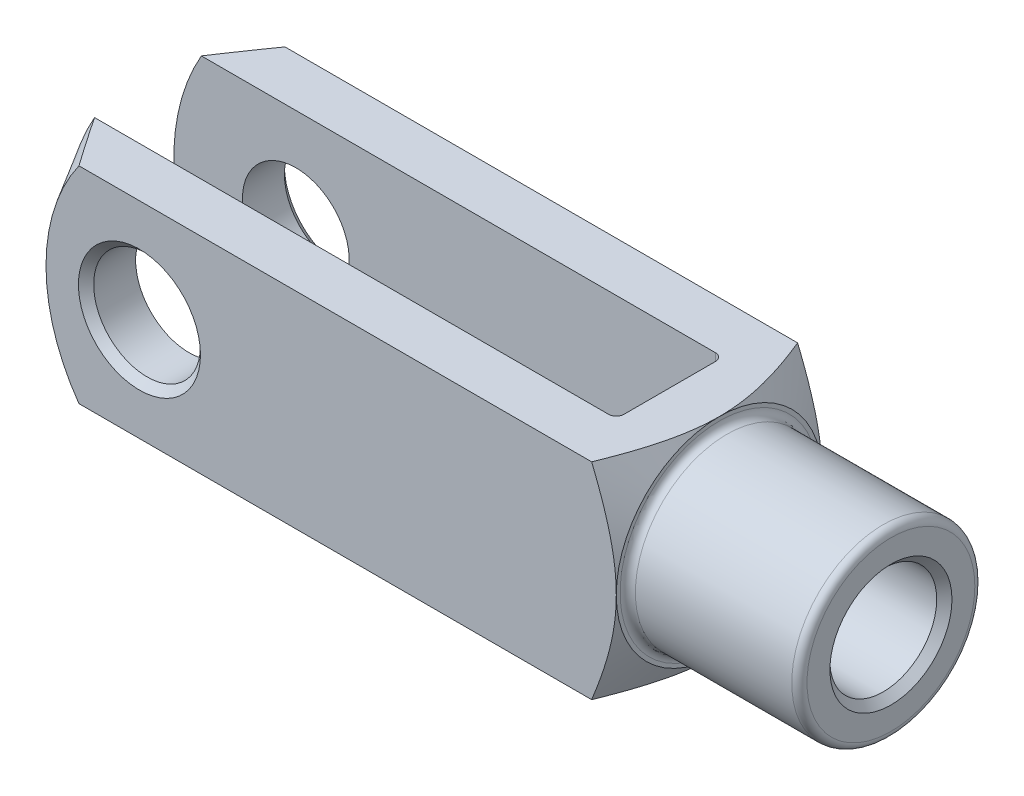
ISO-10303-21;
HEADER;
FILE_DESCRIPTION(('STEP AP214'),'2;1');
FILE_NAME('part.step','',(''),(''),'','','');
FILE_SCHEMA(('AUTOMOTIVE_DESIGN { 1 0 10303 214 1 1 1 1 }'));
ENDSEC;
DATA;
#1=APPLICATION_CONTEXT('core data for automotive mechanical design processes');
#2=APPLICATION_PROTOCOL_DEFINITION('international standard','automotive_design',2000,#1);
#3=PRODUCT_CONTEXT('',#1,'mechanical');
#4=PRODUCT('Part','Part','',(#3));
#5=PRODUCT_RELATED_PRODUCT_CATEGORY('part','',(#4));
#6=PRODUCT_DEFINITION_FORMATION('','',#4);
#7=PRODUCT_DEFINITION_CONTEXT('part definition',#1,'design');
#8=PRODUCT_DEFINITION('design','',#6,#7);
#9=PRODUCT_DEFINITION_SHAPE('','',#8);
#10=(LENGTH_UNIT() NAMED_UNIT(*) SI_UNIT(.MILLI.,.METRE.));
#11=(NAMED_UNIT(*) PLANE_ANGLE_UNIT() SI_UNIT($,.RADIAN.));
#12=(NAMED_UNIT(*) SI_UNIT($,.STERADIAN.) SOLID_ANGLE_UNIT());
#13=UNCERTAINTY_MEASURE_WITH_UNIT(LENGTH_MEASURE(1.E-05),#10,'distance_accuracy_value','');
#14=(GEOMETRIC_REPRESENTATION_CONTEXT(3) GLOBAL_UNCERTAINTY_ASSIGNED_CONTEXT((#13)) GLOBAL_UNIT_ASSIGNED_CONTEXT((#10,
#11,#12)) REPRESENTATION_CONTEXT('',''));
#15=CARTESIAN_POINT('',(0.,0.,0.));
#16=DIRECTION('',(0.,0.,1.));
#17=DIRECTION('',(1.,0.,0.));
#18=AXIS2_PLACEMENT_3D('',#15,#16,#17);
#19=CARTESIAN_POINT('',(-30.,-13.5,-5.99999999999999));
#20=DIRECTION('',(0.,-1.,0.));
#21=DIRECTION('',(0.,0.,-1.));
#22=AXIS2_PLACEMENT_3D('',#19,#20,#21);
#23=CYLINDRICAL_SURFACE('',#22,1.);
#24=DIRECTION('',(0.,1.,0.));
#25=VECTOR('',#24,1.);
#26=CARTESIAN_POINT('',(-29.,-13.5,-5.99999999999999));
#27=LINE('',#26,#25);
#28=CARTESIAN_POINT('',(-29.,-3.605551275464,-5.99999999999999));
#29=VERTEX_POINT('',#28);
#30=CARTESIAN_POINT('',(-29.,-13.5,-5.99999999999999));
#31=VERTEX_POINT('',#30);
#32=EDGE_CURVE('E358',#29,#31,#27,.F.);
#33=ORIENTED_EDGE('',*,*,#32,.F.);
#34=CARTESIAN_POINT('',(-29.,-3.605551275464,-5.99999999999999));
#35=CARTESIAN_POINT('',(-29.000007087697,-3.55494177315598,-6.03041382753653));
#36=CARTESIAN_POINT('',(-29.001386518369,-3.50396296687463,-6.06017529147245));
#37=CARTESIAN_POINT('',(-29.0065960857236,-3.4013852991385,-6.11833715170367));
#38=CARTESIAN_POINT('',(-29.0104251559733,-3.34978671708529,-6.14673813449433));
#39=CARTESIAN_POINT('',(-29.0251248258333,-3.19441978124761,-6.22972265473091));
#40=CARTESIAN_POINT('',(-29.0392107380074,-3.08983806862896,-6.28223313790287));
#41=CARTESIAN_POINT('',(-29.0740643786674,-2.87967288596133,-6.38129477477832));
#42=CARTESIAN_POINT('',(-29.0947990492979,-2.77409682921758,-6.42787385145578));
#43=CARTESIAN_POINT('',(-29.1416261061,-2.56173841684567,-6.51542025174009));
#44=CARTESIAN_POINT('',(-29.1677227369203,-2.45495516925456,-6.55638308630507));
#45=CARTESIAN_POINT('',(-29.2462471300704,-2.1566219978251,-6.66259073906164));
#46=CARTESIAN_POINT('',(-29.3033047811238,-1.9640983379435,-6.72176788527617));
#47=CARTESIAN_POINT('',(-29.4262418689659,-1.57742895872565,-6.82288362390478));
#48=CARTESIAN_POINT('',(-29.4921270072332,-1.38328226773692,-6.86481100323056));
#49=CARTESIAN_POINT('',(-29.6980114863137,-0.798929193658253,-6.96548017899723));
#50=CARTESIAN_POINT('',(-29.8462392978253,-0.406811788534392,-6.99910832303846));
#51=CARTESIAN_POINT('',(-29.9960560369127,-0.010434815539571,-6.99999416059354));
#52=CARTESIAN_POINT('',(-29.998028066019,-0.00521731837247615,-6.99999999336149));
#53=CARTESIAN_POINT('',(-30.,0.,-7.));
#54=B_SPLINE_CURVE_WITH_KNOTS('',3,(#34,#35,#36,#37,#38,#39,#40,#41,#42,#43,#44,#45,#46,#47,#48,
#49,#50,#51,#52,#53),.UNSPECIFIED.,.F.,.F.,(4,2,2,2,2,2,2,2,2,4),(0.,0.17708351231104,
0.354089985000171,0.707258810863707,1.05869820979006,1.41041689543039,2.037236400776,
2.66446272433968,3.91892182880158,3.93565503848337),.UNSPECIFIED.);
#55=CARTESIAN_POINT('',(-30.,0.,-7.));
#56=VERTEX_POINT('',#55);
#57=EDGE_CURVE('E389',#29,#56,#54,.T.);
#58=ORIENTED_EDGE('',*,*,#57,.T.);
#59=DIRECTION('',(0.,1.,0.));
#60=VECTOR('',#59,1.);
#61=CARTESIAN_POINT('',(-30.,13.5,-6.99999999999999));
#62=LINE('',#61,#60);
#63=CARTESIAN_POINT('',(-30.,-13.5,-6.99999999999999));
#64=VERTEX_POINT('',#63);
#65=EDGE_CURVE('E182',#64,#56,#62,.T.);
#66=ORIENTED_EDGE('',*,*,#65,.F.);
#67=CARTESIAN_POINT('',(-30.,-13.5,-5.99999999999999));
#68=DIRECTION('',(0.,-1.,0.));
#69=DIRECTION('',(0.,0.,-1.));
#70=AXIS2_PLACEMENT_3D('',#67,#68,#69);
#71=CIRCLE('',#70,1.);
#72=EDGE_CURVE('E197',#31,#64,#71,.F.);
#73=ORIENTED_EDGE('',*,*,#72,.F.);
#74=EDGE_LOOP('',(#33,#58,#66,#73));
#75=FACE_BOUND('',#74,.T.);
#76=ADVANCED_FACE('F37',(#75),#23,.F.);
#77=CARTESIAN_POINT('',(-29.,-13.5,-6.99999999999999));
#78=DIRECTION('',(1.,0.,0.));
#79=DIRECTION('',(0.,0.,-1.));
#80=AXIS2_PLACEMENT_3D('',#77,#78,#79);
#81=PLANE('',#80);
#82=CARTESIAN_POINT('',(-29.,13.5,-5.99999999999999));
#83=VERTEX_POINT('',#82);
#84=CARTESIAN_POINT('',(-29.,3.605551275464,-5.99999999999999));
#85=VERTEX_POINT('',#84);
#86=EDGE_CURVE('E374',#83,#85,#27,.F.);
#87=ORIENTED_EDGE('',*,*,#86,.T.);
#88=CARTESIAN_POINT('',(-29.,0.,0.));
#89=DIRECTION('',(1.,0.,0.));
#90=DIRECTION('',(0.,0.,-1.));
#91=AXIS2_PLACEMENT_3D('',#88,#89,#90);
#92=CIRCLE('',#91,7.);
#93=CARTESIAN_POINT('',(-29.,3.605551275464,5.99999999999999));
#94=VERTEX_POINT('',#93);
#95=EDGE_CURVE('E414',#85,#94,#92,.T.);
#96=ORIENTED_EDGE('',*,*,#95,.T.);
#97=DIRECTION('',(0.,1.,0.));
#98=VECTOR('',#97,1.);
#99=CARTESIAN_POINT('',(-29.,13.5,6.));
#100=LINE('',#99,#98);
#101=CARTESIAN_POINT('',(-29.,13.5,6.));
#102=VERTEX_POINT('',#101);
#103=EDGE_CURVE('E160',#94,#102,#100,.T.);
#104=ORIENTED_EDGE('',*,*,#103,.T.);
#105=DIRECTION('',(0.,0.,-1.));
#106=VECTOR('',#105,1.);
#107=CARTESIAN_POINT('',(-29.,13.5,-6.99999999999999));
#108=LINE('',#107,#106);
#109=EDGE_CURVE('E338',#102,#83,#108,.T.);
#110=ORIENTED_EDGE('',*,*,#109,.T.);
#111=EDGE_LOOP('',(#87,#96,#104,#110));
#112=FACE_BOUND('',#111,.T.);
#113=ADVANCED_FACE('F460',(#112),#81,.F.);
#114=CARTESIAN_POINT('',(-30.,-13.5,6.));
#115=DIRECTION('',(0.,-1.,0.));
#116=DIRECTION('',(0.,0.,-1.));
#117=AXIS2_PLACEMENT_3D('',#114,#115,#116);
#118=CYLINDRICAL_SURFACE('',#117,1.);
#119=ORIENTED_EDGE('',*,*,#103,.F.);
#120=CARTESIAN_POINT('',(-29.,3.605551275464,6.));
#121=CARTESIAN_POINT('',(-29.000007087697,3.55494177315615,6.03041382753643));
#122=CARTESIAN_POINT('',(-29.001386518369,3.50396296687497,6.06017529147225));
#123=CARTESIAN_POINT('',(-29.0065960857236,3.40138529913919,6.11833715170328));
#124=CARTESIAN_POINT('',(-29.0104251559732,3.34978671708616,6.14673813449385));
#125=CARTESIAN_POINT('',(-29.0251248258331,3.19441978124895,6.22972265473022));
#126=CARTESIAN_POINT('',(-29.0392107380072,3.08983806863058,6.28223313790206));
#127=CARTESIAN_POINT('',(-29.0740643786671,2.87967288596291,6.38129477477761));
#128=CARTESIAN_POINT('',(-29.0947990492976,2.77409682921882,6.42787385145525));
#129=CARTESIAN_POINT('',(-29.1416261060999,2.56173841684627,6.51542025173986));
#130=CARTESIAN_POINT('',(-29.1677227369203,2.45495516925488,6.55638308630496));
#131=CARTESIAN_POINT('',(-29.2462471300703,2.15662199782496,6.66259073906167));
#132=CARTESIAN_POINT('',(-29.3033047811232,1.96409833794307,6.72176788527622));
#133=CARTESIAN_POINT('',(-29.4262418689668,1.5774289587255,6.82288362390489));
#134=CARTESIAN_POINT('',(-29.4921270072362,1.38328226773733,6.8648110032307));
#135=CARTESIAN_POINT('',(-29.6980114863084,0.798929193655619,6.96548017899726));
#136=CARTESIAN_POINT('',(-29.8462392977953,0.406811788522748,6.99910832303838));
#137=CARTESIAN_POINT('',(-29.9960560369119,0.0104348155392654,6.99999416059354));
#138=CARTESIAN_POINT('',(-29.9980280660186,0.00521731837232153,6.99999999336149));
#139=CARTESIAN_POINT('',(-30.,0.,7.));
#140=B_SPLINE_CURVE_WITH_KNOTS('',3,(#120,#121,#122,#123,#124,#125,#126,#127,#128,#129,#130,
#131,#132,#133,#134,#135,#136,#137,#138,#139),.UNSPECIFIED.,.F.,.F.,(4,2,2,2,2,2,2,2,2,4),(0.,
0.177083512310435,0.354089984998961,0.707258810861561,1.05869820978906,1.4104168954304,
2.03723640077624,2.66446272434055,3.91892182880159,3.93565503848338),.UNSPECIFIED.);
#141=CARTESIAN_POINT('',(-30.,0.,7.));
#142=VERTEX_POINT('',#141);
#143=EDGE_CURVE('E145',#94,#142,#140,.T.);
#144=ORIENTED_EDGE('',*,*,#143,.T.);
#145=DIRECTION('',(0.,1.,0.));
#146=VECTOR('',#145,1.);
#147=CARTESIAN_POINT('',(-30.,-13.5,7.));
#148=LINE('',#147,#146);
#149=CARTESIAN_POINT('',(-30.,13.5,7.));
#150=VERTEX_POINT('',#149);
#151=EDGE_CURVE('E159',#150,#142,#148,.F.);
#152=ORIENTED_EDGE('',*,*,#151,.F.);
#153=CARTESIAN_POINT('',(-30.,13.5,6.));
#154=DIRECTION('',(0.,1.,0.));
#155=DIRECTION('',(0.,0.,1.));
#156=AXIS2_PLACEMENT_3D('',#153,#154,#155);
#157=CIRCLE('',#156,1.);
#158=EDGE_CURVE('E189',#102,#150,#157,.F.);
#159=ORIENTED_EDGE('',*,*,#158,.F.);
#160=EDGE_LOOP('',(#119,#144,#152,#159));
#161=FACE_BOUND('',#160,.T.);
#162=ADVANCED_FACE('F156',(#161),#118,.F.);
#163=CARTESIAN_POINT('',(-101.,-13.5,-6.99999999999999));
#164=DIRECTION('',(0.,0.,-1.));
#165=DIRECTION('',(-1.,0.,0.));
#166=AXIS2_PLACEMENT_3D('',#163,#164,#165);
#167=PLANE('',#166);
#168=CARTESIAN_POINT('',(-85.,0.,-6.99999999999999));
#169=DIRECTION('',(0.,0.,-1.));
#170=DIRECTION('',(-1.,0.,0.));
#171=AXIS2_PLACEMENT_3D('',#168,#169,#170);
#172=CIRCLE('',#171,7.);
#173=CARTESIAN_POINT('',(-92.,0.,-6.99999999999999));
#174=VERTEX_POINT('',#173);
#175=EDGE_CURVE('E368',#174,#174,#172,.F.);
#176=ORIENTED_EDGE('',*,*,#175,.F.);
#177=EDGE_LOOP('',(#176));
#178=FACE_BOUND('',#177,.T.);
#179=CARTESIAN_POINT('',(-74.,0.,-6.99999999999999));
#180=DIRECTION('',(0.,0.,1.));
#181=DIRECTION('',(1.,0.,0.));
#182=AXIS2_PLACEMENT_3D('',#179,#180,#181);
#183=CIRCLE('',#182,27.);
#184=CARTESIAN_POINT('',(-97.3826859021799,13.5,-6.99999999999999));
#185=VERTEX_POINT('',#184);
#186=CARTESIAN_POINT('',(-97.3826859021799,-13.5,-6.99999999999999));
#187=VERTEX_POINT('',#186);
#188=EDGE_CURVE('E276',#185,#187,#183,.T.);
#189=ORIENTED_EDGE('',*,*,#188,.T.);
#190=DIRECTION('',(-1.,0.,0.));
#191=VECTOR('',#190,1.);
#192=CARTESIAN_POINT('',(-101.,-13.5,-6.99999999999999));
#193=LINE('',#192,#191);
#194=EDGE_CURVE('E333',#64,#187,#193,.T.);
#195=ORIENTED_EDGE('',*,*,#194,.F.);
#196=ORIENTED_EDGE('',*,*,#65,.T.);
#197=CARTESIAN_POINT('',(-30.,13.5,-6.99999999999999));
#198=VERTEX_POINT('',#197);
#199=EDGE_CURVE('E179',#56,#198,#62,.T.);
#200=ORIENTED_EDGE('',*,*,#199,.T.);
#201=DIRECTION('',(-1.,0.,0.));
#202=VECTOR('',#201,1.);
#203=CARTESIAN_POINT('',(-101.,13.5,-6.99999999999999));
#204=LINE('',#203,#202);
#205=EDGE_CURVE('E346',#198,#185,#204,.T.);
#206=ORIENTED_EDGE('',*,*,#205,.T.);
#207=EDGE_LOOP('',(#189,#195,#196,#200,#206));
#208=FACE_BOUND('',#207,.T.);
#209=ADVANCED_FACE('F392',(#178,#208),#167,.F.);
#210=CARTESIAN_POINT('',(-101.,-13.5,7.00000000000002));
#211=DIRECTION('',(0.,0.,1.));
#212=DIRECTION('',(1.,0.,0.));
#213=AXIS2_PLACEMENT_3D('',#210,#211,#212);
#214=PLANE('',#213);
#215=CARTESIAN_POINT('',(-85.,0.,7.00000000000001));
#216=DIRECTION('',(0.,0.,1.));
#217=DIRECTION('',(1.,0.,0.));
#218=AXIS2_PLACEMENT_3D('',#215,#216,#217);
#219=CIRCLE('',#218,7.);
#220=CARTESIAN_POINT('',(-78.,0.,7.00000000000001));
#221=VERTEX_POINT('',#220);
#222=EDGE_CURVE('E345',#221,#221,#219,.F.);
#223=ORIENTED_EDGE('',*,*,#222,.F.);
#224=EDGE_LOOP('',(#223));
#225=FACE_BOUND('',#224,.T.);
#226=DIRECTION('',(1.,0.,0.));
#227=VECTOR('',#226,1.);
#228=CARTESIAN_POINT('',(-101.,-13.5,7.00000000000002));
#229=LINE('',#228,#227);
#230=CARTESIAN_POINT('',(-97.3826859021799,-13.5,7.00000000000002));
#231=VERTEX_POINT('',#230);
#232=CARTESIAN_POINT('',(-30.,-13.5,7.));
#233=VERTEX_POINT('',#232);
#234=EDGE_CURVE('E337',#231,#233,#229,.T.);
#235=ORIENTED_EDGE('',*,*,#234,.F.);
#236=CARTESIAN_POINT('',(-74.,0.,7.00000000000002));
#237=DIRECTION('',(0.,0.,1.));
#238=DIRECTION('',(1.,0.,0.));
#239=AXIS2_PLACEMENT_3D('',#236,#237,#238);
#240=CIRCLE('',#239,27.);
#241=CARTESIAN_POINT('',(-97.3826859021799,13.5,7.00000000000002));
#242=VERTEX_POINT('',#241);
#243=EDGE_CURVE('E420',#242,#231,#240,.T.);
#244=ORIENTED_EDGE('',*,*,#243,.F.);
#245=DIRECTION('',(1.,0.,0.));
#246=VECTOR('',#245,1.);
#247=CARTESIAN_POINT('',(-101.,13.5,7.00000000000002));
#248=LINE('',#247,#246);
#249=EDGE_CURVE('E176',#242,#150,#248,.T.);
#250=ORIENTED_EDGE('',*,*,#249,.T.);
#251=ORIENTED_EDGE('',*,*,#151,.T.);
#252=EDGE_CURVE('E164',#142,#233,#148,.F.);
#253=ORIENTED_EDGE('',*,*,#252,.T.);
#254=EDGE_LOOP('',(#235,#244,#250,#251,#253));
#255=FACE_BOUND('',#254,.T.);
#256=ADVANCED_FACE('F173',(#225,#255),#214,.F.);
#257=CARTESIAN_POINT('',(-101.,-13.5,13.5));
#258=DIRECTION('',(0.,0.,1.));
#259=DIRECTION('',(1.,0.,0.));
#260=AXIS2_PLACEMENT_3D('',#257,#258,#259);
#261=PLANE('',#260);
#262=CARTESIAN_POINT('',(-85.,0.,13.5));
#263=DIRECTION('',(0.,0.,1.));
#264=DIRECTION('',(1.,0.,0.));
#265=AXIS2_PLACEMENT_3D('',#262,#263,#264);
#266=CIRCLE('',#265,7.99999999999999);
#267=CARTESIAN_POINT('',(-77.,0.,13.5));
#268=VERTEX_POINT('',#267);
#269=EDGE_CURVE('E228',#268,#268,#266,.F.);
#270=ORIENTED_EDGE('',*,*,#269,.T.);
#271=EDGE_LOOP('',(#270));
#272=FACE_BOUND('',#271,.T.);
#273=DIRECTION('',(1.,0.,0.));
#274=VECTOR('',#273,1.);
#275=CARTESIAN_POINT('',(-101.,13.5,13.5));
#276=LINE('',#275,#274);
#277=CARTESIAN_POINT('',(-92.9257335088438,13.5,13.5));
#278=VERTEX_POINT('',#277);
#279=CARTESIAN_POINT('',(-25.7284752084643,13.5,13.5));
#280=VERTEX_POINT('',#279);
#281=EDGE_CURVE('E365',#278,#280,#276,.T.);
#282=ORIENTED_EDGE('',*,*,#281,.F.);
#283=CARTESIAN_POINT('',(-74.,0.,13.5));
#284=DIRECTION('',(0.,0.,1.));
#285=DIRECTION('',(1.,0.,0.));
#286=AXIS2_PLACEMENT_3D('',#283,#284,#285);
#287=CIRCLE('',#286,23.2472232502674);
#288=CARTESIAN_POINT('',(-92.9257335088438,-13.5,13.5));
#289=VERTEX_POINT('',#288);
#290=EDGE_CURVE('E61',#278,#289,#287,.T.);
#291=ORIENTED_EDGE('',*,*,#290,.T.);
#292=DIRECTION('',(1.,0.,0.));
#293=VECTOR('',#292,1.);
#294=CARTESIAN_POINT('',(-101.,-13.5,13.5));
#295=LINE('',#294,#293);
#296=CARTESIAN_POINT('',(-25.7284752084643,-13.5,13.5));
#297=VERTEX_POINT('',#296);
#298=EDGE_CURVE('E362',#289,#297,#295,.T.);
#299=ORIENTED_EDGE('',*,*,#298,.T.);
#300=CARTESIAN_POINT('',(-32.4304291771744,-27.5724587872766,13.5));
#301=CARTESIAN_POINT('',(-32.0854679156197,-26.9070980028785,13.5));
#302=CARTESIAN_POINT('',(-31.7423302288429,-26.240782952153,13.5));
#303=CARTESIAN_POINT('',(-31.0606693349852,-24.9057532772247,13.5));
#304=CARTESIAN_POINT('',(-30.722146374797,-24.2370385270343,13.5));
#305=CARTESIAN_POINT('',(-30.0501346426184,-22.8956223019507,13.5));
#306=CARTESIAN_POINT('',(-29.7166556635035,-22.2229159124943,13.5));
#307=CARTESIAN_POINT('',(-29.0567154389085,-20.8740781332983,13.5));
#308=CARTESIAN_POINT('',(-28.7302540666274,-20.197946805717,13.5));
#309=CARTESIAN_POINT('',(-28.0663268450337,-18.7997650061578,13.5));
#310=CARTESIAN_POINT('',(-27.7294196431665,-18.0774486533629,13.5));
#311=CARTESIAN_POINT('',(-27.0684159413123,-16.6268968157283,13.5));
#312=CARTESIAN_POINT('',(-26.7443201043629,-15.8986610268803,13.5));
#313=CARTESIAN_POINT('',(-26.2709527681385,-14.8009827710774,13.5));
#314=CARTESIAN_POINT('',(-26.1153242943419,-14.4342798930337,13.5));
#315=CARTESIAN_POINT('',(-25.808971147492,-13.6988341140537,13.5));
#316=CARTESIAN_POINT('',(-25.6582463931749,-13.3300912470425,13.5));
#317=CARTESIAN_POINT('',(-25.3624766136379,-12.5903643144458,13.5));
#318=CARTESIAN_POINT('',(-25.217431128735,-12.2193804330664,13.5));
#319=CARTESIAN_POINT('',(-24.9339241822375,-11.4749116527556,13.5));
#320=CARTESIAN_POINT('',(-24.7954625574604,-11.101426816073,13.5));
#321=CARTESIAN_POINT('',(-24.4969840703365,-10.2704027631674,13.5));
#322=CARTESIAN_POINT('',(-24.3388043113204,-9.81219978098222,13.5));
#323=CARTESIAN_POINT('',(-24.0360567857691,-8.89133812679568,13.5));
#324=CARTESIAN_POINT('',(-23.8914878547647,-8.42867983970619,13.5));
#325=CARTESIAN_POINT('',(-23.6186454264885,-7.49855908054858,13.5));
#326=CARTESIAN_POINT('',(-23.4903715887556,-7.03109670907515,13.5));
#327=CARTESIAN_POINT('',(-23.253182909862,-6.09124666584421,13.5));
#328=CARTESIAN_POINT('',(-23.1442678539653,-5.61885904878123,13.5));
#329=CARTESIAN_POINT('',(-22.9513715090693,-4.68052707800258,13.5));
#330=CARTESIAN_POINT('',(-22.8668649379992,-4.21469177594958,13.5));
#331=CARTESIAN_POINT('',(-22.7224231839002,-3.2791949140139,13.5));
#332=CARTESIAN_POINT('',(-22.662487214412,-2.80953347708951,13.5));
#333=CARTESIAN_POINT('',(-22.5696920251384,-1.86781820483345,13.5));
#334=CARTESIAN_POINT('',(-22.5368151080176,-1.39576613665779,13.5));
#335=CARTESIAN_POINT('',(-22.4995884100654,-0.450533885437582,13.5));
#336=CARTESIAN_POINT('',(-22.4952376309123,0.022646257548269,13.5));
#337=CARTESIAN_POINT('',(-22.5145298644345,0.933916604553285,13.5));
#338=CARTESIAN_POINT('',(-22.5361561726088,1.37205133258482,13.5));
#339=CARTESIAN_POINT('',(-22.6032147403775,2.24647569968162,13.5));
#340=CARTESIAN_POINT('',(-22.6486469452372,2.68276534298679,13.5));
#341=CARTESIAN_POINT('',(-22.7616517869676,3.55266413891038,13.5));
#342=CARTESIAN_POINT('',(-22.8292358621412,3.98627178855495,13.5));
#343=CARTESIAN_POINT('',(-22.9843161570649,4.84988834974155,13.5));
#344=CARTESIAN_POINT('',(-23.0718129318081,5.27989716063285,13.5));
#345=CARTESIAN_POINT('',(-23.2670701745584,6.14834375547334,13.5));
#346=CARTESIAN_POINT('',(-23.3753438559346,6.58666526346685,13.5));
#347=CARTESIAN_POINT('',(-23.6077854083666,7.45904439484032,13.5));
#348=CARTESIAN_POINT('',(-23.7319534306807,7.89310197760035,13.5));
#349=CARTESIAN_POINT('',(-23.9937810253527,8.75708887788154,13.5));
#350=CARTESIAN_POINT('',(-24.1314399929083,9.18701837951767,13.5));
#351=CARTESIAN_POINT('',(-24.3464699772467,9.82901563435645,13.5));
#352=CARTESIAN_POINT('',(-24.4195690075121,10.0425285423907,13.5));
#353=CARTESIAN_POINT('',(-24.568387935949,10.4686386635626,13.5));
#354=CARTESIAN_POINT('',(-24.6441078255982,10.6812358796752,13.5));
#355=CARTESIAN_POINT('',(-24.8874050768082,11.3522977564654,13.5));
#356=CARTESIAN_POINT('',(-25.0593999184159,11.809164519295,13.5));
#357=CARTESIAN_POINT('',(-25.4127281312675,12.7192834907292,13.5));
#358=CARTESIAN_POINT('',(-25.5940620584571,13.1725354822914,13.5));
#359=CARTESIAN_POINT('',(-25.9645603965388,14.0759400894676,13.5));
#360=CARTESIAN_POINT('',(-26.1537265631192,14.5260919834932,13.5));
#361=CARTESIAN_POINT('',(-26.5385867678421,15.4235797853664,13.5));
#362=CARTESIAN_POINT('',(-26.7342806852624,15.8709157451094,13.5));
#363=CARTESIAN_POINT('',(-27.1313434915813,16.7635184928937,13.5));
#364=CARTESIAN_POINT('',(-27.3327171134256,17.2087831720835,13.5));
#365=CARTESIAN_POINT('',(-27.7401463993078,18.0971674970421,13.5));
#366=CARTESIAN_POINT('',(-27.9462021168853,18.540287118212,13.5));
#367=CARTESIAN_POINT('',(-28.5702761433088,19.8667324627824,13.5));
#368=CARTESIAN_POINT('',(-28.994251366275,20.747256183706,13.5));
#369=CARTESIAN_POINT('',(-29.8552271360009,22.5052140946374,13.5));
#370=CARTESIAN_POINT('',(-30.2922634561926,23.3826306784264,13.5));
#371=CARTESIAN_POINT('',(-31.175287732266,25.1329651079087,13.5));
#372=CARTESIAN_POINT('',(-31.6212758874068,26.0058828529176,13.5));
#373=CARTESIAN_POINT('',(-32.5199360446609,27.7477195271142,13.5));
#374=CARTESIAN_POINT('',(-32.9726046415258,28.6166402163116,13.5));
#375=CARTESIAN_POINT('',(-33.8833677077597,30.351621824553,13.5));
#376=CARTESIAN_POINT('',(-34.3414621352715,31.2176827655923,13.5));
#377=CARTESIAN_POINT('',(-35.1936403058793,32.8190461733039,13.5));
#378=CARTESIAN_POINT('',(-35.587127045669,33.5546666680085,13.5));
#379=CARTESIAN_POINT('',(-36.3767395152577,35.0244904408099,13.5));
#380=CARTESIAN_POINT('',(-36.7728652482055,35.7586937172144,13.5));
#381=CARTESIAN_POINT('',(-37.9646720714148,37.9597111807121,13.5));
#382=CARTESIAN_POINT('',(-38.7636731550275,39.4247275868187,13.5));
#383=CARTESIAN_POINT('',(-40.3635150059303,42.3428467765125,13.5));
#384=CARTESIAN_POINT('',(-41.1643190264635,43.7959697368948,13.5));
#385=CARTESIAN_POINT('',(-42.3690675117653,45.9735433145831,13.5));
#386=CARTESIAN_POINT('',(-42.7712089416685,46.6989923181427,13.5));
#387=CARTESIAN_POINT('',(-43.5765516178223,48.1493007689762,13.5));
#388=CARTESIAN_POINT('',(-43.9797528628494,48.8741602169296,13.5));
#389=CARTESIAN_POINT('',(-44.3834136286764,49.5987636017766,13.5));
#390=B_SPLINE_CURVE_WITH_KNOTS('',3,(#300,#301,#302,#303,#304,#305,#306,#307,#308,#309,#310,
#311,#312,#313,#314,#315,#316,#317,#318,#319,#320,#321,#322,#323,#324,#325,#326,#327,#328,#329,
#330,#331,#332,#333,#334,#335,#336,#337,#338,#339,#340,#341,#342,#343,#344,#345,#346,#347,#348,
#349,#350,#351,#352,#353,#354,#355,#356,#357,#358,#359,#360,#361,#362,#363,#364,#365,#366,#367,
#368,#369,#370,#371,#372,#373,#374,#375,#376,#377,#378,#379,#380,#381,#382,#383,#384,#385,#386,
#387,#388,#389),.UNSPECIFIED.,.F.,.F.,(4,2,2,2,2,2,2,2,2,2,2,2,2,2,2,2,2,2,2,2,2,2,2,2,2,2,2,2,
2,2,2,2,2,2,2,2,2,2,2,2,2,2,2,2,4),(0.,2.24841482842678,4.49694948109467,6.7493996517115,
9.00180908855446,11.3927930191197,13.7839005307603,14.9789541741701,16.1739880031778,
17.3689249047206,18.5638321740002,20.0178658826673,21.4717750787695,22.9256538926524,
24.379516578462,25.7992511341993,27.2189402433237,28.6377000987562,30.056410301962,
31.3717442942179,32.6870752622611,34.0030864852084,35.3191343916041,36.6732741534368,
38.02742680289,39.3815187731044,40.0585434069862,40.7355658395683,42.1999363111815,
43.6643940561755,45.1291818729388,46.5939426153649,48.0599622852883,49.5259987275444,
52.4577049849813,55.3983502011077,58.3390609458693,61.2783212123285,64.2175588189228,
66.7202960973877,69.223036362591,74.229215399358,79.2067218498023,81.6950831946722,
84.1834416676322),.UNSPECIFIED.);
#391=CARTESIAN_POINT('',(-22.5,0.,13.5));
#392=VERTEX_POINT('',#391);
#393=EDGE_CURVE('E305',#392,#297,#390,.F.);
#394=ORIENTED_EDGE('',*,*,#393,.F.);
#395=EDGE_CURVE('E303',#280,#392,#390,.F.);
#396=ORIENTED_EDGE('',*,*,#395,.F.);
#397=EDGE_LOOP('',(#282,#291,#299,#394,#396));
#398=FACE_BOUND('',#397,.T.);
#399=ADVANCED_FACE('F287',(#272,#398),#261,.T.);
#400=CARTESIAN_POINT('',(-101.,-13.5,13.5));
#401=DIRECTION('',(0.,-1.,0.));
#402=DIRECTION('',(0.,0.,-1.));
#403=AXIS2_PLACEMENT_3D('',#400,#401,#402);
#404=PLANE('',#403);
#405=ORIENTED_EDGE('',*,*,#194,.T.);
#406=CARTESIAN_POINT('',(-114.335378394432,-13.5,19.9067277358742));
#407=CARTESIAN_POINT('',(-113.589742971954,-13.5,18.6820817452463));
#408=CARTESIAN_POINT('',(-112.842635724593,-13.5,17.4583291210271));
#409=CARTESIAN_POINT('',(-111.344819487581,-13.5,15.0130165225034));
#410=CARTESIAN_POINT('',(-110.59411046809,-13.5,13.7914565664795));
#411=CARTESIAN_POINT('',(-109.08835575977,-13.5,11.350810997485));
#412=CARTESIAN_POINT('',(-108.33330956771,-13.5,10.1317256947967));
#413=CARTESIAN_POINT('',(-106.818093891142,-13.5,7.69674639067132));
#414=CARTESIAN_POINT('',(-106.057924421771,-13.5,6.48085237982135));
#415=CARTESIAN_POINT('',(-104.533017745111,-13.5,4.05566502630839));
#416=CARTESIAN_POINT('',(-103.768294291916,-13.5,2.84636304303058));
#417=CARTESIAN_POINT('',(-102.231147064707,-13.5,0.432665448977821));
#418=CARTESIAN_POINT('',(-101.458723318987,-13.5,-0.77173017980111));
#419=CARTESIAN_POINT('',(-99.9041541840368,-13.5,-3.17431337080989));
#420=CARTESIAN_POINT('',(-99.1220084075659,-13.5,-4.37250068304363));
#421=CARTESIAN_POINT('',(-97.9394271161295,-13.5,-6.1635918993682));
#422=CARTESIAN_POINT('',(-97.5436743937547,-13.5,-6.75958848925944));
#423=CARTESIAN_POINT('',(-96.7485806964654,-13.5,-7.94918226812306));
#424=CARTESIAN_POINT('',(-96.3492397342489,-13.5,-8.54277946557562));
#425=CARTESIAN_POINT('',(-95.5457822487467,-13.5,-9.72812510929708));
#426=CARTESIAN_POINT('',(-95.1416590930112,-13.5,-10.319869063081));
#427=CARTESIAN_POINT('',(-94.328600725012,-13.5,-11.500038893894));
#428=CARTESIAN_POINT('',(-93.9196655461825,-13.5,-12.0884647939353));
#429=CARTESIAN_POINT('',(-93.096256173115,-13.5,-13.2612199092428));
#430=CARTESIAN_POINT('',(-92.6817833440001,-13.5,-13.845550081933));
#431=CARTESIAN_POINT('',(-91.8461635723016,-13.5,-15.0094493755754));
#432=CARTESIAN_POINT('',(-91.4250164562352,-13.5,-15.5890183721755));
#433=CARTESIAN_POINT('',(-90.5742466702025,-13.5,-16.7429906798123));
#434=CARTESIAN_POINT('',(-90.1446143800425,-13.5,-17.3173869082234));
#435=CARTESIAN_POINT('',(-89.2757290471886,-13.5,-18.4588171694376));
#436=CARTESIAN_POINT('',(-88.8364767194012,-13.5,-19.0258517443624));
#437=CARTESIAN_POINT('',(-88.1685494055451,-13.5,-19.8695905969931));
#438=CARTESIAN_POINT('',(-87.9443098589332,-13.5,-20.1498090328));
#439=CARTESIAN_POINT('',(-87.4925201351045,-13.5,-20.7075596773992));
#440=CARTESIAN_POINT('',(-87.2649700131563,-13.5,-20.9850919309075));
#441=CARTESIAN_POINT('',(-86.8061154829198,-13.5,-21.5371561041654));
#442=CARTESIAN_POINT('',(-86.5748101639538,-13.5,-21.811687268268));
#443=CARTESIAN_POINT('',(-86.108015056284,-13.5,-22.3571941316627));
#444=CARTESIAN_POINT('',(-85.8725250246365,-13.5,-22.628169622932));
#445=CARTESIAN_POINT('',(-85.6347136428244,-13.5,-22.8971084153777));
#446=B_SPLINE_CURVE_WITH_KNOTS('',3,(#406,#407,#408,#409,#410,#411,#412,#413,#414,#415,#416,
#417,#418,#419,#420,#421,#422,#423,#424,#425,#426,#427,#428,#429,#430,#431,#432,#433,#434,#435,
#436,#437,#438,#439,#440,#441,#442,#443,#444,#445),.UNSPECIFIED.,.F.,.F.,(4,2,2,2,2,2,2,2,2,2,2,
2,2,2,2,2,2,2,2,4),(0.,4.30134760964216,8.60273091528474,12.904623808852,17.206503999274,
21.4989060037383,25.7912922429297,30.0838500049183,32.2301130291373,34.376368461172,
36.5260664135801,38.6757494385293,40.8249119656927,42.9741304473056,45.1259441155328,
47.2775984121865,48.3542633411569,49.4309103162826,50.5078224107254,51.5847972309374),.UNSPECIFIED.);
#447=CARTESIAN_POINT('',(-92.9257335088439,-13.5,-13.5));
#448=VERTEX_POINT('',#447);
#449=EDGE_CURVE('E275',#187,#448,#446,.T.);
#450=ORIENTED_EDGE('',*,*,#449,.T.);
#451=DIRECTION('',(1.,0.,0.));
#452=VECTOR('',#451,1.);
#453=CARTESIAN_POINT('',(-101.,-13.5,-13.5));
#454=LINE('',#453,#452);
#455=CARTESIAN_POINT('',(-25.7284752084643,-13.5,-13.5));
#456=VERTEX_POINT('',#455);
#457=EDGE_CURVE('E359',#448,#456,#454,.T.);
#458=ORIENTED_EDGE('',*,*,#457,.T.);
#459=CARTESIAN_POINT('',(-32.4304291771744,-13.5,-27.5724587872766));
#460=CARTESIAN_POINT('',(-32.0854679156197,-13.5,-26.9070980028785));
#461=CARTESIAN_POINT('',(-31.7423302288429,-13.5,-26.240782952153));
#462=CARTESIAN_POINT('',(-31.0606693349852,-13.5,-24.9057532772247));
#463=CARTESIAN_POINT('',(-30.722146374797,-13.5,-24.2370385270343));
#464=CARTESIAN_POINT('',(-30.0501346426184,-13.5,-22.8956223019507));
#465=CARTESIAN_POINT('',(-29.7166556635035,-13.5,-22.2229159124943));
#466=CARTESIAN_POINT('',(-29.0567154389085,-13.5,-20.8740781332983));
#467=CARTESIAN_POINT('',(-28.7302540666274,-13.5,-20.197946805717));
#468=CARTESIAN_POINT('',(-28.0663268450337,-13.5,-18.7997650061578));
#469=CARTESIAN_POINT('',(-27.7294196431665,-13.5,-18.0774486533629));
#470=CARTESIAN_POINT('',(-27.0684159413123,-13.5,-16.6268968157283));
#471=CARTESIAN_POINT('',(-26.7443201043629,-13.5,-15.8986610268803));
#472=CARTESIAN_POINT('',(-26.2709527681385,-13.5,-14.8009827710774));
#473=CARTESIAN_POINT('',(-26.1153242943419,-13.5,-14.4342798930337));
#474=CARTESIAN_POINT('',(-25.808971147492,-13.5,-13.6988341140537));
#475=CARTESIAN_POINT('',(-25.6582463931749,-13.5,-13.3300912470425));
#476=CARTESIAN_POINT('',(-25.3624766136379,-13.5,-12.5903643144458));
#477=CARTESIAN_POINT('',(-25.217431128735,-13.5,-12.2193804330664));
#478=CARTESIAN_POINT('',(-24.9339241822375,-13.5,-11.4749116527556));
#479=CARTESIAN_POINT('',(-24.7954625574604,-13.5,-11.101426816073));
#480=CARTESIAN_POINT('',(-24.4969840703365,-13.5,-10.2704027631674));
#481=CARTESIAN_POINT('',(-24.3388043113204,-13.5,-9.81219978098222));
#482=CARTESIAN_POINT('',(-24.0360567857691,-13.5,-8.89133812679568));
#483=CARTESIAN_POINT('',(-23.8914878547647,-13.5,-8.42867983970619));
#484=CARTESIAN_POINT('',(-23.6186454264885,-13.5,-7.49855908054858));
#485=CARTESIAN_POINT('',(-23.4903715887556,-13.5,-7.03109670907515));
#486=CARTESIAN_POINT('',(-23.253182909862,-13.5,-6.09124666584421));
#487=CARTESIAN_POINT('',(-23.1442678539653,-13.5,-5.61885904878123));
#488=CARTESIAN_POINT('',(-22.9513715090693,-13.5,-4.68052707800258));
#489=CARTESIAN_POINT('',(-22.8668649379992,-13.5,-4.21469177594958));
#490=CARTESIAN_POINT('',(-22.7224231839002,-13.5,-3.2791949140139));
#491=CARTESIAN_POINT('',(-22.662487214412,-13.5,-2.80953347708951));
#492=CARTESIAN_POINT('',(-22.5696920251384,-13.5,-1.86781820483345));
#493=CARTESIAN_POINT('',(-22.5368151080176,-13.5,-1.39576613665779));
#494=CARTESIAN_POINT('',(-22.4995884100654,-13.5,-0.450533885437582));
#495=CARTESIAN_POINT('',(-22.4952376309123,-13.5,0.022646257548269));
#496=CARTESIAN_POINT('',(-22.5145298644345,-13.5,0.933916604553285));
#497=CARTESIAN_POINT('',(-22.5361561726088,-13.5,1.37205133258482));
#498=CARTESIAN_POINT('',(-22.6032147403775,-13.5,2.24647569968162));
#499=CARTESIAN_POINT('',(-22.6486469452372,-13.5,2.68276534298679));
#500=CARTESIAN_POINT('',(-22.7616517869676,-13.5,3.55266413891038));
#501=CARTESIAN_POINT('',(-22.8292358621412,-13.5,3.98627178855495));
#502=CARTESIAN_POINT('',(-22.9843161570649,-13.5,4.84988834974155));
#503=CARTESIAN_POINT('',(-23.0718129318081,-13.5,5.27989716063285));
#504=CARTESIAN_POINT('',(-23.2670701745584,-13.5,6.14834375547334));
#505=CARTESIAN_POINT('',(-23.3753438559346,-13.5,6.58666526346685));
#506=CARTESIAN_POINT('',(-23.6077854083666,-13.5,7.45904439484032));
#507=CARTESIAN_POINT('',(-23.7319534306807,-13.5,7.89310197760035));
#508=CARTESIAN_POINT('',(-23.9937810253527,-13.5,8.75708887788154));
#509=CARTESIAN_POINT('',(-24.1314399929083,-13.5,9.18701837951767));
#510=CARTESIAN_POINT('',(-24.3464699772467,-13.5,9.82901563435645));
#511=CARTESIAN_POINT('',(-24.4195690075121,-13.5,10.0425285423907));
#512=CARTESIAN_POINT('',(-24.568387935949,-13.5,10.4686386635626));
#513=CARTESIAN_POINT('',(-24.6441078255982,-13.5,10.6812358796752));
#514=CARTESIAN_POINT('',(-24.8874050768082,-13.5,11.3522977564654));
#515=CARTESIAN_POINT('',(-25.0593999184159,-13.5,11.809164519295));
#516=CARTESIAN_POINT('',(-25.4127281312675,-13.5,12.7192834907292));
#517=CARTESIAN_POINT('',(-25.5940620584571,-13.5,13.1725354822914));
#518=CARTESIAN_POINT('',(-25.9645603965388,-13.5,14.0759400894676));
#519=CARTESIAN_POINT('',(-26.1537265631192,-13.5,14.5260919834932));
#520=CARTESIAN_POINT('',(-26.5385867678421,-13.5,15.4235797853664));
#521=CARTESIAN_POINT('',(-26.7342806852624,-13.5,15.8709157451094));
#522=CARTESIAN_POINT('',(-27.1313434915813,-13.5,16.7635184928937));
#523=CARTESIAN_POINT('',(-27.3327171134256,-13.5,17.2087831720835));
#524=CARTESIAN_POINT('',(-27.7401463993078,-13.5,18.0971674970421));
#525=CARTESIAN_POINT('',(-27.9462021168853,-13.5,18.540287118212));
#526=CARTESIAN_POINT('',(-28.5702761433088,-13.5,19.8667324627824));
#527=CARTESIAN_POINT('',(-28.994251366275,-13.5,20.747256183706));
#528=CARTESIAN_POINT('',(-29.8552271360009,-13.5,22.5052140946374));
#529=CARTESIAN_POINT('',(-30.2922634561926,-13.5,23.3826306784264));
#530=CARTESIAN_POINT('',(-31.175287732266,-13.5,25.1329651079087));
#531=CARTESIAN_POINT('',(-31.6212758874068,-13.5,26.0058828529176));
#532=CARTESIAN_POINT('',(-32.5199360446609,-13.5,27.7477195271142));
#533=CARTESIAN_POINT('',(-32.9726046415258,-13.5,28.6166402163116));
#534=CARTESIAN_POINT('',(-33.8833677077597,-13.5,30.351621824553));
#535=CARTESIAN_POINT('',(-34.3414621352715,-13.5,31.2176827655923));
#536=CARTESIAN_POINT('',(-35.1936403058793,-13.5,32.8190461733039));
#537=CARTESIAN_POINT('',(-35.587127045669,-13.5,33.5546666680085));
#538=CARTESIAN_POINT('',(-36.3767395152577,-13.5,35.0244904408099));
#539=CARTESIAN_POINT('',(-36.7728652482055,-13.5,35.7586937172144));
#540=CARTESIAN_POINT('',(-37.9646720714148,-13.5,37.9597111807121));
#541=CARTESIAN_POINT('',(-38.7636731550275,-13.5,39.4247275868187));
#542=CARTESIAN_POINT('',(-40.3635150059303,-13.5,42.3428467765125));
#543=CARTESIAN_POINT('',(-41.1643190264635,-13.5,43.7959697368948));
#544=CARTESIAN_POINT('',(-42.3690675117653,-13.5,45.9735433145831));
#545=CARTESIAN_POINT('',(-42.7712089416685,-13.5,46.6989923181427));
#546=CARTESIAN_POINT('',(-43.5765516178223,-13.5,48.1493007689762));
#547=CARTESIAN_POINT('',(-43.9797528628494,-13.5,48.8741602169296));
#548=CARTESIAN_POINT('',(-44.3834136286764,-13.5,49.5987636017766));
#549=B_SPLINE_CURVE_WITH_KNOTS('',3,(#459,#460,#461,#462,#463,#464,#465,#466,#467,#468,#469,
#470,#471,#472,#473,#474,#475,#476,#477,#478,#479,#480,#481,#482,#483,#484,#485,#486,#487,#488,
#489,#490,#491,#492,#493,#494,#495,#496,#497,#498,#499,#500,#501,#502,#503,#504,#505,#506,#507,
#508,#509,#510,#511,#512,#513,#514,#515,#516,#517,#518,#519,#520,#521,#522,#523,#524,#525,#526,
#527,#528,#529,#530,#531,#532,#533,#534,#535,#536,#537,#538,#539,#540,#541,#542,#543,#544,#545,
#546,#547,#548),.UNSPECIFIED.,.F.,.F.,(4,2,2,2,2,2,2,2,2,2,2,2,2,2,2,2,2,2,2,2,2,2,2,2,2,2,2,2,
2,2,2,2,2,2,2,2,2,2,2,2,2,2,2,2,4),(0.,2.24841482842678,4.49694948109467,6.7493996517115,
9.00180908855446,11.3927930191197,13.7839005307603,14.9789541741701,16.1739880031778,
17.3689249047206,18.5638321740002,20.0178658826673,21.4717750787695,22.9256538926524,
24.379516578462,25.7992511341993,27.2189402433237,28.6377000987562,30.056410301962,
31.3717442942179,32.6870752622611,34.0030864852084,35.3191343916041,36.6732741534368,
38.02742680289,39.3815187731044,40.0585434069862,40.7355658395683,42.1999363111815,
43.6643940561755,45.1291818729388,46.5939426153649,48.0599622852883,49.5259987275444,
52.4577049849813,55.3983502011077,58.3390609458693,61.2783212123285,64.2175588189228,
66.7202960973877,69.223036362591,74.229215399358,79.2067218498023,81.6950831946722,
84.1834416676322),.UNSPECIFIED.);
#550=CARTESIAN_POINT('',(-22.5,-13.5,0.));
#551=VERTEX_POINT('',#550);
#552=EDGE_CURVE('E304',#551,#456,#549,.F.);
#553=ORIENTED_EDGE('',*,*,#552,.F.);
#554=EDGE_CURVE('E295',#297,#551,#549,.F.);
#555=ORIENTED_EDGE('',*,*,#554,.F.);
#556=ORIENTED_EDGE('',*,*,#298,.F.);
#557=CARTESIAN_POINT('',(-85.6347136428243,-13.5,22.8971084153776));
#558=CARTESIAN_POINT('',(-85.8725250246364,-13.5,22.6281696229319));
#559=CARTESIAN_POINT('',(-86.108015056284,-13.5,22.3571941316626));
#560=CARTESIAN_POINT('',(-86.5748101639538,-13.5,21.8116872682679));
#561=CARTESIAN_POINT('',(-86.8061154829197,-13.5,21.5371561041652));
#562=CARTESIAN_POINT('',(-87.2649700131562,-13.5,20.9850919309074));
#563=CARTESIAN_POINT('',(-87.4925201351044,-13.5,20.7075596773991));
#564=CARTESIAN_POINT('',(-87.9443098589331,-13.5,20.1498090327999));
#565=CARTESIAN_POINT('',(-88.168549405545,-13.5,19.869590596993));
#566=CARTESIAN_POINT('',(-88.8364767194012,-13.5,19.0258517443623));
#567=CARTESIAN_POINT('',(-89.2757290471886,-13.5,18.4588171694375));
#568=CARTESIAN_POINT('',(-90.1446143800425,-13.5,17.3173869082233));
#569=CARTESIAN_POINT('',(-90.5742466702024,-13.5,16.7429906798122));
#570=CARTESIAN_POINT('',(-91.4250164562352,-13.5,15.5890183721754));
#571=CARTESIAN_POINT('',(-91.8461635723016,-13.5,15.0094493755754));
#572=CARTESIAN_POINT('',(-92.6817833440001,-13.5,13.8455500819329));
#573=CARTESIAN_POINT('',(-93.096256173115,-13.5,13.2612199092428));
#574=CARTESIAN_POINT('',(-93.9196655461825,-13.5,12.0884647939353));
#575=CARTESIAN_POINT('',(-94.328600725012,-13.5,11.500038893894));
#576=CARTESIAN_POINT('',(-95.1416590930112,-13.5,10.319869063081));
#577=CARTESIAN_POINT('',(-95.5457822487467,-13.5,9.7281251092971));
#578=CARTESIAN_POINT('',(-96.3492397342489,-13.5,8.54277946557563));
#579=CARTESIAN_POINT('',(-96.7485806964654,-13.5,7.94918226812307));
#580=CARTESIAN_POINT('',(-97.5436743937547,-13.5,6.75958848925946));
#581=CARTESIAN_POINT('',(-97.9394271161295,-13.5,6.16359189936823));
#582=CARTESIAN_POINT('',(-99.1220084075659,-13.5,4.37250068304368));
#583=CARTESIAN_POINT('',(-99.9041541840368,-13.5,3.17431337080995));
#584=CARTESIAN_POINT('',(-101.458723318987,-13.5,0.77173017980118));
#585=CARTESIAN_POINT('',(-102.231147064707,-13.5,-0.432665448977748));
#586=CARTESIAN_POINT('',(-103.768294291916,-13.5,-2.8463630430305));
#587=CARTESIAN_POINT('',(-104.533017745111,-13.5,-4.05566502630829));
#588=CARTESIAN_POINT('',(-106.057924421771,-13.5,-6.48085237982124));
#589=CARTESIAN_POINT('',(-106.818093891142,-13.5,-7.6967463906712));
#590=CARTESIAN_POINT('',(-108.33330956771,-13.5,-10.1317256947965));
#591=CARTESIAN_POINT('',(-109.08835575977,-13.5,-11.3508109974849));
#592=CARTESIAN_POINT('',(-110.59411046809,-13.5,-13.7914565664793));
#593=CARTESIAN_POINT('',(-111.344819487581,-13.5,-15.0130165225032));
#594=CARTESIAN_POINT('',(-112.842635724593,-13.5,-17.4583291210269));
#595=CARTESIAN_POINT('',(-113.589742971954,-13.5,-18.6820817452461));
#596=CARTESIAN_POINT('',(-114.335378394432,-13.5,-19.906727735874));
#597=B_SPLINE_CURVE_WITH_KNOTS('',3,(#557,#558,#559,#560,#561,#562,#563,#564,#565,#566,#567,
#568,#569,#570,#571,#572,#573,#574,#575,#576,#577,#578,#579,#580,#581,#582,#583,#584,#585,#586,
#587,#588,#589,#590,#591,#592,#593,#594,#595,#596),.UNSPECIFIED.,.F.,.F.,(4,2,2,2,2,2,2,2,2,2,2,
2,2,2,2,2,2,2,2,4),(0.,1.076974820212,2.15388691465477,3.23053388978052,4.3071988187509,
6.45885311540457,8.61066678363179,10.7598852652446,12.9090477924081,15.0587308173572,
17.2084287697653,19.3546842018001,21.500947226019,25.7935049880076,30.0858912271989,
34.3782932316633,38.6801734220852,42.9820663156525,47.283449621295,51.5847972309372),.UNSPECIFIED.);
#598=EDGE_CURVE('E266',#289,#231,#597,.T.);
#599=ORIENTED_EDGE('',*,*,#598,.T.);
#600=ORIENTED_EDGE('',*,*,#234,.T.);
#601=CARTESIAN_POINT('',(-30.,-13.5,6.));
#602=DIRECTION('',(0.,-1.,0.));
#603=DIRECTION('',(0.,0.,-1.));
#604=AXIS2_PLACEMENT_3D('',#601,#602,#603);
#605=CIRCLE('',#604,1.);
#606=CARTESIAN_POINT('',(-29.,-13.5,6.));
#607=VERTEX_POINT('',#606);
#608=EDGE_CURVE('E166',#233,#607,#605,.F.);
#609=ORIENTED_EDGE('',*,*,#608,.T.);
#610=DIRECTION('',(0.,0.,-1.));
#611=VECTOR('',#610,1.);
#612=CARTESIAN_POINT('',(-29.,-13.5,-6.99999999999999));
#613=LINE('',#612,#611);
#614=EDGE_CURVE('E341',#607,#31,#613,.T.);
#615=ORIENTED_EDGE('',*,*,#614,.T.);
#616=ORIENTED_EDGE('',*,*,#72,.T.);
#617=EDGE_LOOP('',(#405,#450,#458,#553,#555,#556,#599,#600,#609,#615,#616));
#618=FACE_BOUND('',#617,.T.);
#619=ADVANCED_FACE('F282',(#618),#404,.T.);
#620=CARTESIAN_POINT('',(-101.,-13.5,-13.5));
#621=DIRECTION('',(0.,0.,-1.));
#622=DIRECTION('',(-1.,0.,0.));
#623=AXIS2_PLACEMENT_3D('',#620,#621,#622);
#624=PLANE('',#623);
#625=CARTESIAN_POINT('',(-85.,0.,-13.5));
#626=DIRECTION('',(0.,0.,-1.));
#627=DIRECTION('',(-1.,0.,0.));
#628=AXIS2_PLACEMENT_3D('',#625,#626,#627);
#629=CIRCLE('',#628,7.99999999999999);
#630=CARTESIAN_POINT('',(-93.,0.,-13.5));
#631=VERTEX_POINT('',#630);
#632=EDGE_CURVE('E216',#631,#631,#629,.F.);
#633=ORIENTED_EDGE('',*,*,#632,.T.);
#634=EDGE_LOOP('',(#633));
#635=FACE_BOUND('',#634,.T.);
#636=ORIENTED_EDGE('',*,*,#457,.F.);
#637=CARTESIAN_POINT('',(-74.,0.,-13.5));
#638=DIRECTION('',(0.,0.,1.));
#639=DIRECTION('',(1.,0.,0.));
#640=AXIS2_PLACEMENT_3D('',#637,#638,#639);
#641=CIRCLE('',#640,23.2472232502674);
#642=CARTESIAN_POINT('',(-92.9257335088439,13.5,-13.5));
#643=VERTEX_POINT('',#642);
#644=EDGE_CURVE('E405',#643,#448,#641,.T.);
#645=ORIENTED_EDGE('',*,*,#644,.F.);
#646=DIRECTION('',(1.,0.,0.));
#647=VECTOR('',#646,1.);
#648=CARTESIAN_POINT('',(-101.,13.5,-13.5));
#649=LINE('',#648,#647);
#650=CARTESIAN_POINT('',(-25.7284752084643,13.5,-13.5));
#651=VERTEX_POINT('',#650);
#652=EDGE_CURVE('E355',#643,#651,#649,.T.);
#653=ORIENTED_EDGE('',*,*,#652,.T.);
#654=CARTESIAN_POINT('',(-32.4304291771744,-27.5724587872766,-13.5));
#655=CARTESIAN_POINT('',(-32.0854679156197,-26.9070980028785,-13.5));
#656=CARTESIAN_POINT('',(-31.7423302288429,-26.240782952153,-13.5));
#657=CARTESIAN_POINT('',(-31.0606693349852,-24.9057532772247,-13.5));
#658=CARTESIAN_POINT('',(-30.722146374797,-24.2370385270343,-13.5));
#659=CARTESIAN_POINT('',(-30.0501346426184,-22.8956223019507,-13.5));
#660=CARTESIAN_POINT('',(-29.7166556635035,-22.2229159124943,-13.5));
#661=CARTESIAN_POINT('',(-29.0567154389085,-20.8740781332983,-13.5));
#662=CARTESIAN_POINT('',(-28.7302540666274,-20.197946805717,-13.5));
#663=CARTESIAN_POINT('',(-28.0663268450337,-18.7997650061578,-13.5));
#664=CARTESIAN_POINT('',(-27.7294196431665,-18.0774486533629,-13.5));
#665=CARTESIAN_POINT('',(-27.0684159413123,-16.6268968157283,-13.5));
#666=CARTESIAN_POINT('',(-26.7443201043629,-15.8986610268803,-13.5));
#667=CARTESIAN_POINT('',(-26.2709527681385,-14.8009827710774,-13.5));
#668=CARTESIAN_POINT('',(-26.1153242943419,-14.4342798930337,-13.5));
#669=CARTESIAN_POINT('',(-25.808971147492,-13.6988341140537,-13.5));
#670=CARTESIAN_POINT('',(-25.6582463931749,-13.3300912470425,-13.5));
#671=CARTESIAN_POINT('',(-25.3624766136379,-12.5903643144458,-13.5));
#672=CARTESIAN_POINT('',(-25.217431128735,-12.2193804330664,-13.5));
#673=CARTESIAN_POINT('',(-24.9339241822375,-11.4749116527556,-13.5));
#674=CARTESIAN_POINT('',(-24.7954625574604,-11.101426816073,-13.5));
#675=CARTESIAN_POINT('',(-24.4969840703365,-10.2704027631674,-13.5));
#676=CARTESIAN_POINT('',(-24.3388043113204,-9.81219978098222,-13.5));
#677=CARTESIAN_POINT('',(-24.0360567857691,-8.89133812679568,-13.5));
#678=CARTESIAN_POINT('',(-23.8914878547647,-8.42867983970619,-13.5));
#679=CARTESIAN_POINT('',(-23.6186454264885,-7.49855908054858,-13.5));
#680=CARTESIAN_POINT('',(-23.4903715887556,-7.03109670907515,-13.5));
#681=CARTESIAN_POINT('',(-23.253182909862,-6.09124666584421,-13.5));
#682=CARTESIAN_POINT('',(-23.1442678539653,-5.61885904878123,-13.5));
#683=CARTESIAN_POINT('',(-22.9513715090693,-4.68052707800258,-13.5));
#684=CARTESIAN_POINT('',(-22.8668649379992,-4.21469177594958,-13.5));
#685=CARTESIAN_POINT('',(-22.7224231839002,-3.2791949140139,-13.5));
#686=CARTESIAN_POINT('',(-22.662487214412,-2.80953347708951,-13.5));
#687=CARTESIAN_POINT('',(-22.5696920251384,-1.86781820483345,-13.5));
#688=CARTESIAN_POINT('',(-22.5368151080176,-1.39576613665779,-13.5));
#689=CARTESIAN_POINT('',(-22.4995884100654,-0.450533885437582,-13.5));
#690=CARTESIAN_POINT('',(-22.4952376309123,0.022646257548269,-13.5));
#691=CARTESIAN_POINT('',(-22.5145298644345,0.933916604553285,-13.5));
#692=CARTESIAN_POINT('',(-22.5361561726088,1.37205133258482,-13.5));
#693=CARTESIAN_POINT('',(-22.6032147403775,2.24647569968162,-13.5));
#694=CARTESIAN_POINT('',(-22.6486469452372,2.68276534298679,-13.5));
#695=CARTESIAN_POINT('',(-22.7616517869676,3.55266413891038,-13.5));
#696=CARTESIAN_POINT('',(-22.8292358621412,3.98627178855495,-13.5));
#697=CARTESIAN_POINT('',(-22.9843161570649,4.84988834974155,-13.5));
#698=CARTESIAN_POINT('',(-23.0718129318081,5.27989716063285,-13.5));
#699=CARTESIAN_POINT('',(-23.2670701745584,6.14834375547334,-13.5));
#700=CARTESIAN_POINT('',(-23.3753438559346,6.58666526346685,-13.5));
#701=CARTESIAN_POINT('',(-23.6077854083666,7.45904439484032,-13.5));
#702=CARTESIAN_POINT('',(-23.7319534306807,7.89310197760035,-13.5));
#703=CARTESIAN_POINT('',(-23.9937810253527,8.75708887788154,-13.5));
#704=CARTESIAN_POINT('',(-24.1314399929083,9.18701837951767,-13.5));
#705=CARTESIAN_POINT('',(-24.3464699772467,9.82901563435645,-13.5));
#706=CARTESIAN_POINT('',(-24.4195690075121,10.0425285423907,-13.5));
#707=CARTESIAN_POINT('',(-24.568387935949,10.4686386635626,-13.5));
#708=CARTESIAN_POINT('',(-24.6441078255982,10.6812358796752,-13.5));
#709=CARTESIAN_POINT('',(-24.8874050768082,11.3522977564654,-13.5));
#710=CARTESIAN_POINT('',(-25.0593999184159,11.809164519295,-13.5));
#711=CARTESIAN_POINT('',(-25.4127281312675,12.7192834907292,-13.5));
#712=CARTESIAN_POINT('',(-25.5940620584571,13.1725354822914,-13.5));
#713=CARTESIAN_POINT('',(-25.9645603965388,14.0759400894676,-13.5));
#714=CARTESIAN_POINT('',(-26.1537265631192,14.5260919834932,-13.5));
#715=CARTESIAN_POINT('',(-26.5385867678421,15.4235797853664,-13.5));
#716=CARTESIAN_POINT('',(-26.7342806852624,15.8709157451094,-13.5));
#717=CARTESIAN_POINT('',(-27.1313434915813,16.7635184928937,-13.5));
#718=CARTESIAN_POINT('',(-27.3327171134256,17.2087831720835,-13.5));
#719=CARTESIAN_POINT('',(-27.7401463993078,18.0971674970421,-13.5));
#720=CARTESIAN_POINT('',(-27.9462021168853,18.540287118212,-13.5));
#721=CARTESIAN_POINT('',(-28.5702761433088,19.8667324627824,-13.5));
#722=CARTESIAN_POINT('',(-28.994251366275,20.747256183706,-13.5));
#723=CARTESIAN_POINT('',(-29.8552271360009,22.5052140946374,-13.5));
#724=CARTESIAN_POINT('',(-30.2922634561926,23.3826306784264,-13.5));
#725=CARTESIAN_POINT('',(-31.175287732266,25.1329651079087,-13.5));
#726=CARTESIAN_POINT('',(-31.6212758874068,26.0058828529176,-13.5));
#727=CARTESIAN_POINT('',(-32.5199360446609,27.7477195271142,-13.5));
#728=CARTESIAN_POINT('',(-32.9726046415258,28.6166402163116,-13.5));
#729=CARTESIAN_POINT('',(-33.8833677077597,30.351621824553,-13.5));
#730=CARTESIAN_POINT('',(-34.3414621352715,31.2176827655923,-13.5));
#731=CARTESIAN_POINT('',(-35.1936403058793,32.8190461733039,-13.5));
#732=CARTESIAN_POINT('',(-35.587127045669,33.5546666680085,-13.5));
#733=CARTESIAN_POINT('',(-36.3767395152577,35.0244904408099,-13.5));
#734=CARTESIAN_POINT('',(-36.7728652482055,35.7586937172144,-13.5));
#735=CARTESIAN_POINT('',(-37.9646720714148,37.9597111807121,-13.5));
#736=CARTESIAN_POINT('',(-38.7636731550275,39.4247275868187,-13.5));
#737=CARTESIAN_POINT('',(-40.3635150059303,42.3428467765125,-13.5));
#738=CARTESIAN_POINT('',(-41.1643190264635,43.7959697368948,-13.5));
#739=CARTESIAN_POINT('',(-42.3690675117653,45.9735433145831,-13.5));
#740=CARTESIAN_POINT('',(-42.7712089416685,46.6989923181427,-13.5));
#741=CARTESIAN_POINT('',(-43.5765516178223,48.1493007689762,-13.5));
#742=CARTESIAN_POINT('',(-43.9797528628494,48.8741602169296,-13.5));
#743=CARTESIAN_POINT('',(-44.3834136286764,49.5987636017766,-13.5));
#744=B_SPLINE_CURVE_WITH_KNOTS('',3,(#654,#655,#656,#657,#658,#659,#660,#661,#662,#663,#664,
#665,#666,#667,#668,#669,#670,#671,#672,#673,#674,#675,#676,#677,#678,#679,#680,#681,#682,#683,
#684,#685,#686,#687,#688,#689,#690,#691,#692,#693,#694,#695,#696,#697,#698,#699,#700,#701,#702,
#703,#704,#705,#706,#707,#708,#709,#710,#711,#712,#713,#714,#715,#716,#717,#718,#719,#720,#721,
#722,#723,#724,#725,#726,#727,#728,#729,#730,#731,#732,#733,#734,#735,#736,#737,#738,#739,#740,
#741,#742,#743),.UNSPECIFIED.,.F.,.F.,(4,2,2,2,2,2,2,2,2,2,2,2,2,2,2,2,2,2,2,2,2,2,2,2,2,2,2,2,
2,2,2,2,2,2,2,2,2,2,2,2,2,2,2,2,4),(0.,2.24841482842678,4.49694948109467,6.7493996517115,
9.00180908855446,11.3927930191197,13.7839005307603,14.9789541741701,16.1739880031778,
17.3689249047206,18.5638321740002,20.0178658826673,21.4717750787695,22.9256538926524,
24.379516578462,25.7992511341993,27.2189402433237,28.6377000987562,30.056410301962,
31.3717442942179,32.6870752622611,34.0030864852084,35.3191343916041,36.6732741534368,
38.02742680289,39.3815187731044,40.0585434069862,40.7355658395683,42.1999363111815,
43.6643940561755,45.1291818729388,46.5939426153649,48.0599622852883,49.5259987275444,
52.4577049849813,55.3983502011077,58.3390609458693,61.2783212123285,64.2175588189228,
66.7202960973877,69.223036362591,74.229215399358,79.2067218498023,81.6950831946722,
84.1834416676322),.UNSPECIFIED.);
#745=CARTESIAN_POINT('',(-22.5,0.,-13.5));
#746=VERTEX_POINT('',#745);
#747=EDGE_CURVE('E325',#746,#651,#744,.T.);
#748=ORIENTED_EDGE('',*,*,#747,.F.);
#749=EDGE_CURVE('E332',#456,#746,#744,.T.);
#750=ORIENTED_EDGE('',*,*,#749,.F.);
#751=EDGE_LOOP('',(#636,#645,#653,#748,#750));
#752=FACE_BOUND('',#751,.T.);
#753=ADVANCED_FACE('F286',(#635,#752),#624,.T.);
#754=CARTESIAN_POINT('',(-101.,13.5,13.5));
#755=DIRECTION('',(0.,1.,0.));
#756=DIRECTION('',(0.,0.,1.));
#757=AXIS2_PLACEMENT_3D('',#754,#755,#756);
#758=PLANE('',#757);
#759=ORIENTED_EDGE('',*,*,#652,.F.);
#760=CARTESIAN_POINT('',(-85.6347136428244,13.5,-22.8971084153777));
#761=CARTESIAN_POINT('',(-85.8725250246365,13.5,-22.628169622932));
#762=CARTESIAN_POINT('',(-86.108015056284,13.5,-22.3571941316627));
#763=CARTESIAN_POINT('',(-86.5748101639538,13.5,-21.811687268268));
#764=CARTESIAN_POINT('',(-86.8061154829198,13.5,-21.5371561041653));
#765=CARTESIAN_POINT('',(-87.2649700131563,13.5,-20.9850919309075));
#766=CARTESIAN_POINT('',(-87.4925201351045,13.5,-20.7075596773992));
#767=CARTESIAN_POINT('',(-87.9443098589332,13.5,-20.1498090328));
#768=CARTESIAN_POINT('',(-88.1685494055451,13.5,-19.8695905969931));
#769=CARTESIAN_POINT('',(-88.8364767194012,13.5,-19.0258517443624));
#770=CARTESIAN_POINT('',(-89.2757290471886,13.5,-18.4588171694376));
#771=CARTESIAN_POINT('',(-90.1446143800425,13.5,-17.3173869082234));
#772=CARTESIAN_POINT('',(-90.5742466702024,13.5,-16.7429906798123));
#773=CARTESIAN_POINT('',(-91.4250164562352,13.5,-15.5890183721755));
#774=CARTESIAN_POINT('',(-91.8461635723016,13.5,-15.0094493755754));
#775=CARTESIAN_POINT('',(-92.6817833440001,13.5,-13.845550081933));
#776=CARTESIAN_POINT('',(-93.096256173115,13.5,-13.2612199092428));
#777=CARTESIAN_POINT('',(-93.9196655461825,13.5,-12.0884647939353));
#778=CARTESIAN_POINT('',(-94.328600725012,13.5,-11.500038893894));
#779=CARTESIAN_POINT('',(-95.1416590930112,13.5,-10.319869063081));
#780=CARTESIAN_POINT('',(-95.5457822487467,13.5,-9.72812510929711));
#781=CARTESIAN_POINT('',(-96.3492397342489,13.5,-8.54277946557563));
#782=CARTESIAN_POINT('',(-96.7485806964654,13.5,-7.94918226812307));
#783=CARTESIAN_POINT('',(-97.5436743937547,13.5,-6.75958848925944));
#784=CARTESIAN_POINT('',(-97.9394271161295,13.5,-6.16359189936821));
#785=CARTESIAN_POINT('',(-99.1220084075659,13.5,-4.37250068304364));
#786=CARTESIAN_POINT('',(-99.9041541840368,13.5,-3.1743133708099));
#787=CARTESIAN_POINT('',(-101.458723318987,13.5,-0.771730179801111));
#788=CARTESIAN_POINT('',(-102.231147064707,13.5,0.43266544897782));
#789=CARTESIAN_POINT('',(-103.768294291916,13.5,2.84636304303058));
#790=CARTESIAN_POINT('',(-104.533017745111,13.5,4.05566502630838));
#791=CARTESIAN_POINT('',(-106.057924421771,13.5,6.48085237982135));
#792=CARTESIAN_POINT('',(-106.818093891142,13.5,7.69674639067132));
#793=CARTESIAN_POINT('',(-108.33330956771,13.5,10.1317256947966));
#794=CARTESIAN_POINT('',(-109.08835575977,13.5,11.350810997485));
#795=CARTESIAN_POINT('',(-110.59411046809,13.5,13.7914565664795));
#796=CARTESIAN_POINT('',(-111.344819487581,13.5,15.0130165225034));
#797=CARTESIAN_POINT('',(-112.842635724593,13.5,17.4583291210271));
#798=CARTESIAN_POINT('',(-113.589742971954,13.5,18.6820817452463));
#799=CARTESIAN_POINT('',(-114.335378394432,13.5,19.9067277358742));
#800=B_SPLINE_CURVE_WITH_KNOTS('',3,(#760,#761,#762,#763,#764,#765,#766,#767,#768,#769,#770,
#771,#772,#773,#774,#775,#776,#777,#778,#779,#780,#781,#782,#783,#784,#785,#786,#787,#788,#789,
#790,#791,#792,#793,#794,#795,#796,#797,#798,#799),.UNSPECIFIED.,.F.,.F.,(4,2,2,2,2,2,2,2,2,2,2,
2,2,2,2,2,2,2,2,4),(0.,1.076974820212,2.15388691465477,3.23053388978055,4.30719881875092,
6.45885311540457,8.61066678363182,10.7598852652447,12.9090477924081,15.0587308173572,
17.2084287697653,19.3546842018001,21.5009472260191,25.7935049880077,30.0858912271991,
34.3782932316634,38.6801734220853,42.9820663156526,47.2834496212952,51.5847972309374),.UNSPECIFIED.);
#801=EDGE_CURVE('E246',#643,#185,#800,.T.);
#802=ORIENTED_EDGE('',*,*,#801,.T.);
#803=ORIENTED_EDGE('',*,*,#205,.F.);
#804=CARTESIAN_POINT('',(-30.,13.5,-5.99999999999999));
#805=DIRECTION('',(0.,1.,0.));
#806=DIRECTION('',(0.,0.,1.));
#807=AXIS2_PLACEMENT_3D('',#804,#805,#806);
#808=CIRCLE('',#807,1.);
#809=EDGE_CURVE('E194',#198,#83,#808,.F.);
#810=ORIENTED_EDGE('',*,*,#809,.T.);
#811=ORIENTED_EDGE('',*,*,#109,.F.);
#812=ORIENTED_EDGE('',*,*,#158,.T.);
#813=ORIENTED_EDGE('',*,*,#249,.F.);
#814=CARTESIAN_POINT('',(-114.335378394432,13.5,-19.906727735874));
#815=CARTESIAN_POINT('',(-113.589742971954,13.5,-18.6820817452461));
#816=CARTESIAN_POINT('',(-112.842635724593,13.5,-17.4583291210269));
#817=CARTESIAN_POINT('',(-111.344819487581,13.5,-15.0130165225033));
#818=CARTESIAN_POINT('',(-110.59411046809,13.5,-13.7914565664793));
#819=CARTESIAN_POINT('',(-109.08835575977,13.5,-11.3508109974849));
#820=CARTESIAN_POINT('',(-108.33330956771,13.5,-10.1317256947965));
#821=CARTESIAN_POINT('',(-106.818093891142,13.5,-7.6967463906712));
#822=CARTESIAN_POINT('',(-106.057924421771,13.5,-6.48085237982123));
#823=CARTESIAN_POINT('',(-104.533017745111,13.5,-4.05566502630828));
#824=CARTESIAN_POINT('',(-103.768294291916,13.5,-2.8463630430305));
#825=CARTESIAN_POINT('',(-102.231147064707,13.5,-0.432665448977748));
#826=CARTESIAN_POINT('',(-101.458723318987,13.5,0.771730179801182));
#827=CARTESIAN_POINT('',(-99.9041541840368,13.5,3.17431337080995));
#828=CARTESIAN_POINT('',(-99.1220084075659,13.5,4.37250068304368));
#829=CARTESIAN_POINT('',(-97.9394271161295,13.5,6.16359189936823));
#830=CARTESIAN_POINT('',(-97.5436743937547,13.5,6.75958848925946));
#831=CARTESIAN_POINT('',(-96.7485806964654,13.5,7.94918226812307));
#832=CARTESIAN_POINT('',(-96.3492397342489,13.5,8.54277946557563));
#833=CARTESIAN_POINT('',(-95.5457822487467,13.5,9.72812510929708));
#834=CARTESIAN_POINT('',(-95.1416590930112,13.5,10.319869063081));
#835=CARTESIAN_POINT('',(-94.328600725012,13.5,11.500038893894));
#836=CARTESIAN_POINT('',(-93.9196655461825,13.5,12.0884647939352));
#837=CARTESIAN_POINT('',(-93.096256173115,13.5,13.2612199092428));
#838=CARTESIAN_POINT('',(-92.6817833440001,13.5,13.8455500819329));
#839=CARTESIAN_POINT('',(-91.8461635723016,13.5,15.0094493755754));
#840=CARTESIAN_POINT('',(-91.4250164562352,13.5,15.5890183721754));
#841=CARTESIAN_POINT('',(-90.5742466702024,13.5,16.7429906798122));
#842=CARTESIAN_POINT('',(-90.1446143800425,13.5,17.3173869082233));
#843=CARTESIAN_POINT('',(-89.2757290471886,13.5,18.4588171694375));
#844=CARTESIAN_POINT('',(-88.8364767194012,13.5,19.0258517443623));
#845=CARTESIAN_POINT('',(-88.1685494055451,13.5,19.869590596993));
#846=CARTESIAN_POINT('',(-87.9443098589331,13.5,20.1498090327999));
#847=CARTESIAN_POINT('',(-87.4925201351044,13.5,20.7075596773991));
#848=CARTESIAN_POINT('',(-87.2649700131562,13.5,20.9850919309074));
#849=CARTESIAN_POINT('',(-86.8061154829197,13.5,21.5371561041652));
#850=CARTESIAN_POINT('',(-86.5748101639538,13.5,21.8116872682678));
#851=CARTESIAN_POINT('',(-86.108015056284,13.5,22.3571941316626));
#852=CARTESIAN_POINT('',(-85.8725250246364,13.5,22.6281696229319));
#853=CARTESIAN_POINT('',(-85.6347136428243,13.5,22.8971084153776));
#854=B_SPLINE_CURVE_WITH_KNOTS('',3,(#814,#815,#816,#817,#818,#819,#820,#821,#822,#823,#824,
#825,#826,#827,#828,#829,#830,#831,#832,#833,#834,#835,#836,#837,#838,#839,#840,#841,#842,#843,
#844,#845,#846,#847,#848,#849,#850,#851,#852,#853),.UNSPECIFIED.,.F.,.F.,(4,2,2,2,2,2,2,2,2,2,2,
2,2,2,2,2,2,2,2,4),(0.,4.30134760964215,8.6027309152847,12.904623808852,17.2065039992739,
21.4989060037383,25.7912922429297,30.0838500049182,32.2301130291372,34.3763684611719,
36.52606641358,38.6757494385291,40.8249119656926,42.9741304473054,45.1259441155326,
47.2775984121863,48.3542633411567,49.4309103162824,50.5078224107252,51.5847972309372),.UNSPECIFIED.);
#855=EDGE_CURVE('E238',#242,#278,#854,.T.);
#856=ORIENTED_EDGE('',*,*,#855,.T.);
#857=ORIENTED_EDGE('',*,*,#281,.T.);
#858=CARTESIAN_POINT('',(-32.4304291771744,13.5,-27.5724587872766));
#859=CARTESIAN_POINT('',(-32.0854679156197,13.5,-26.9070980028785));
#860=CARTESIAN_POINT('',(-31.7423302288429,13.5,-26.240782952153));
#861=CARTESIAN_POINT('',(-31.0606693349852,13.5,-24.9057532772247));
#862=CARTESIAN_POINT('',(-30.722146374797,13.5,-24.2370385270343));
#863=CARTESIAN_POINT('',(-30.0501346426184,13.5,-22.8956223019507));
#864=CARTESIAN_POINT('',(-29.7166556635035,13.5,-22.2229159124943));
#865=CARTESIAN_POINT('',(-29.0567154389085,13.5,-20.8740781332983));
#866=CARTESIAN_POINT('',(-28.7302540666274,13.5,-20.197946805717));
#867=CARTESIAN_POINT('',(-28.0663268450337,13.5,-18.7997650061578));
#868=CARTESIAN_POINT('',(-27.7294196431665,13.5,-18.0774486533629));
#869=CARTESIAN_POINT('',(-27.0684159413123,13.5,-16.6268968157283));
#870=CARTESIAN_POINT('',(-26.7443201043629,13.5,-15.8986610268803));
#871=CARTESIAN_POINT('',(-26.2709527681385,13.5,-14.8009827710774));
#872=CARTESIAN_POINT('',(-26.1153242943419,13.5,-14.4342798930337));
#873=CARTESIAN_POINT('',(-25.808971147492,13.5,-13.6988341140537));
#874=CARTESIAN_POINT('',(-25.6582463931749,13.5,-13.3300912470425));
#875=CARTESIAN_POINT('',(-25.3624766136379,13.5,-12.5903643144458));
#876=CARTESIAN_POINT('',(-25.217431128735,13.5,-12.2193804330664));
#877=CARTESIAN_POINT('',(-24.9339241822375,13.5,-11.4749116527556));
#878=CARTESIAN_POINT('',(-24.7954625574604,13.5,-11.101426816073));
#879=CARTESIAN_POINT('',(-24.4969840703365,13.5,-10.2704027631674));
#880=CARTESIAN_POINT('',(-24.3388043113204,13.5,-9.81219978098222));
#881=CARTESIAN_POINT('',(-24.0360567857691,13.5,-8.89133812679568));
#882=CARTESIAN_POINT('',(-23.8914878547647,13.5,-8.42867983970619));
#883=CARTESIAN_POINT('',(-23.6186454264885,13.5,-7.49855908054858));
#884=CARTESIAN_POINT('',(-23.4903715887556,13.5,-7.03109670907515));
#885=CARTESIAN_POINT('',(-23.253182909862,13.5,-6.09124666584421));
#886=CARTESIAN_POINT('',(-23.1442678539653,13.5,-5.61885904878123));
#887=CARTESIAN_POINT('',(-22.9513715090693,13.5,-4.68052707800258));
#888=CARTESIAN_POINT('',(-22.8668649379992,13.5,-4.21469177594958));
#889=CARTESIAN_POINT('',(-22.7224231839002,13.5,-3.2791949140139));
#890=CARTESIAN_POINT('',(-22.662487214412,13.5,-2.80953347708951));
#891=CARTESIAN_POINT('',(-22.5696920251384,13.5,-1.86781820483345));
#892=CARTESIAN_POINT('',(-22.5368151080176,13.5,-1.39576613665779));
#893=CARTESIAN_POINT('',(-22.4995884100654,13.5,-0.450533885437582));
#894=CARTESIAN_POINT('',(-22.4952376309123,13.5,0.022646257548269));
#895=CARTESIAN_POINT('',(-22.5145298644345,13.5,0.933916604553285));
#896=CARTESIAN_POINT('',(-22.5361561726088,13.5,1.37205133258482));
#897=CARTESIAN_POINT('',(-22.6032147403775,13.5,2.24647569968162));
#898=CARTESIAN_POINT('',(-22.6486469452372,13.5,2.68276534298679));
#899=CARTESIAN_POINT('',(-22.7616517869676,13.5,3.55266413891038));
#900=CARTESIAN_POINT('',(-22.8292358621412,13.5,3.98627178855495));
#901=CARTESIAN_POINT('',(-22.9843161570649,13.5,4.84988834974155));
#902=CARTESIAN_POINT('',(-23.0718129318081,13.5,5.27989716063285));
#903=CARTESIAN_POINT('',(-23.2670701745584,13.5,6.14834375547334));
#904=CARTESIAN_POINT('',(-23.3753438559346,13.5,6.58666526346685));
#905=CARTESIAN_POINT('',(-23.6077854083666,13.5,7.45904439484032));
#906=CARTESIAN_POINT('',(-23.7319534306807,13.5,7.89310197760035));
#907=CARTESIAN_POINT('',(-23.9937810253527,13.5,8.75708887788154));
#908=CARTESIAN_POINT('',(-24.1314399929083,13.5,9.18701837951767));
#909=CARTESIAN_POINT('',(-24.3464699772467,13.5,9.82901563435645));
#910=CARTESIAN_POINT('',(-24.4195690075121,13.5,10.0425285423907));
#911=CARTESIAN_POINT('',(-24.568387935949,13.5,10.4686386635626));
#912=CARTESIAN_POINT('',(-24.6441078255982,13.5,10.6812358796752));
#913=CARTESIAN_POINT('',(-24.8874050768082,13.5,11.3522977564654));
#914=CARTESIAN_POINT('',(-25.0593999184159,13.5,11.809164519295));
#915=CARTESIAN_POINT('',(-25.4127281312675,13.5,12.7192834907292));
#916=CARTESIAN_POINT('',(-25.5940620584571,13.5,13.1725354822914));
#917=CARTESIAN_POINT('',(-25.9645603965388,13.5,14.0759400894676));
#918=CARTESIAN_POINT('',(-26.1537265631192,13.5,14.5260919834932));
#919=CARTESIAN_POINT('',(-26.5385867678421,13.5,15.4235797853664));
#920=CARTESIAN_POINT('',(-26.7342806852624,13.5,15.8709157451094));
#921=CARTESIAN_POINT('',(-27.1313434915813,13.5,16.7635184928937));
#922=CARTESIAN_POINT('',(-27.3327171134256,13.5,17.2087831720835));
#923=CARTESIAN_POINT('',(-27.7401463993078,13.5,18.0971674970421));
#924=CARTESIAN_POINT('',(-27.9462021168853,13.5,18.540287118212));
#925=CARTESIAN_POINT('',(-28.5702761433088,13.5,19.8667324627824));
#926=CARTESIAN_POINT('',(-28.994251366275,13.5,20.747256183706));
#927=CARTESIAN_POINT('',(-29.8552271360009,13.5,22.5052140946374));
#928=CARTESIAN_POINT('',(-30.2922634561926,13.5,23.3826306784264));
#929=CARTESIAN_POINT('',(-31.175287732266,13.5,25.1329651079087));
#930=CARTESIAN_POINT('',(-31.6212758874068,13.5,26.0058828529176));
#931=CARTESIAN_POINT('',(-32.5199360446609,13.5,27.7477195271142));
#932=CARTESIAN_POINT('',(-32.9726046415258,13.5,28.6166402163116));
#933=CARTESIAN_POINT('',(-33.8833677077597,13.5,30.351621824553));
#934=CARTESIAN_POINT('',(-34.3414621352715,13.5,31.2176827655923));
#935=CARTESIAN_POINT('',(-35.1936403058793,13.5,32.8190461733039));
#936=CARTESIAN_POINT('',(-35.587127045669,13.5,33.5546666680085));
#937=CARTESIAN_POINT('',(-36.3767395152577,13.5,35.0244904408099));
#938=CARTESIAN_POINT('',(-36.7728652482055,13.5,35.7586937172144));
#939=CARTESIAN_POINT('',(-37.9646720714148,13.5,37.9597111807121));
#940=CARTESIAN_POINT('',(-38.7636731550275,13.5,39.4247275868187));
#941=CARTESIAN_POINT('',(-40.3635150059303,13.5,42.3428467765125));
#942=CARTESIAN_POINT('',(-41.1643190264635,13.5,43.7959697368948));
#943=CARTESIAN_POINT('',(-42.3690675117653,13.5,45.9735433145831));
#944=CARTESIAN_POINT('',(-42.7712089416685,13.5,46.6989923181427));
#945=CARTESIAN_POINT('',(-43.5765516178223,13.5,48.1493007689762));
#946=CARTESIAN_POINT('',(-43.9797528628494,13.5,48.8741602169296));
#947=CARTESIAN_POINT('',(-44.3834136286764,13.5,49.5987636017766));
#948=B_SPLINE_CURVE_WITH_KNOTS('',3,(#858,#859,#860,#861,#862,#863,#864,#865,#866,#867,#868,
#869,#870,#871,#872,#873,#874,#875,#876,#877,#878,#879,#880,#881,#882,#883,#884,#885,#886,#887,
#888,#889,#890,#891,#892,#893,#894,#895,#896,#897,#898,#899,#900,#901,#902,#903,#904,#905,#906,
#907,#908,#909,#910,#911,#912,#913,#914,#915,#916,#917,#918,#919,#920,#921,#922,#923,#924,#925,
#926,#927,#928,#929,#930,#931,#932,#933,#934,#935,#936,#937,#938,#939,#940,#941,#942,#943,#944,
#945,#946,#947),.UNSPECIFIED.,.F.,.F.,(4,2,2,2,2,2,2,2,2,2,2,2,2,2,2,2,2,2,2,2,2,2,2,2,2,2,2,2,
2,2,2,2,2,2,2,2,2,2,2,2,2,2,2,2,4),(0.,2.24841482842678,4.49694948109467,6.7493996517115,
9.00180908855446,11.3927930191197,13.7839005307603,14.9789541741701,16.1739880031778,
17.3689249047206,18.5638321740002,20.0178658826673,21.4717750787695,22.9256538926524,
24.379516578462,25.7992511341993,27.2189402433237,28.6377000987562,30.056410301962,
31.3717442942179,32.6870752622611,34.0030864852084,35.3191343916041,36.6732741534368,
38.02742680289,39.3815187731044,40.0585434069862,40.7355658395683,42.1999363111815,
43.6643940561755,45.1291818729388,46.5939426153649,48.0599622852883,49.5259987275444,
52.4577049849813,55.3983502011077,58.3390609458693,61.2783212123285,64.2175588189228,
66.7202960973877,69.223036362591,74.229215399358,79.2067218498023,81.6950831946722,
84.1834416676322),.UNSPECIFIED.);
#949=CARTESIAN_POINT('',(-22.5,13.5,0.));
#950=VERTEX_POINT('',#949);
#951=EDGE_CURVE('E302',#950,#280,#948,.T.);
#952=ORIENTED_EDGE('',*,*,#951,.F.);
#953=EDGE_CURVE('E450',#651,#950,#948,.T.);
#954=ORIENTED_EDGE('',*,*,#953,.F.);
#955=EDGE_LOOP('',(#759,#802,#803,#810,#811,#812,#813,#856,#857,#952,#954));
#956=FACE_BOUND('',#955,.T.);
#957=ADVANCED_FACE('F251',(#956),#758,.T.);
#958=CARTESIAN_POINT('',(-22.5,0.,0.));
#959=DIRECTION('',(1.,0.,0.));
#960=DIRECTION('',(0.,0.,-1.));
#961=AXIS2_PLACEMENT_3D('',#958,#959,#960);
#962=PLANE('',#961);
#963=CARTESIAN_POINT('',(-22.5,0.,0.));
#964=DIRECTION('',(1.,0.,0.));
#965=DIRECTION('',(0.,0.,-1.));
#966=AXIS2_PLACEMENT_3D('',#963,#964,#965);
#967=CIRCLE('',#966,13.5);
#968=EDGE_CURVE('E237',#746,#551,#967,.F.);
#969=ORIENTED_EDGE('',*,*,#968,.F.);
#970=EDGE_CURVE('E232',#950,#746,#967,.F.);
#971=ORIENTED_EDGE('',*,*,#970,.F.);
#972=CARTESIAN_POINT('',(-22.5,0.,0.));
#973=DIRECTION('',(-1.,0.,0.));
#974=DIRECTION('',(0.,0.,1.));
#975=AXIS2_PLACEMENT_3D('',#972,#973,#974);
#976=CIRCLE('',#975,13.5);
#977=EDGE_CURVE('E401',#392,#950,#976,.T.);
#978=ORIENTED_EDGE('',*,*,#977,.F.);
#979=EDGE_CURVE('E236',#551,#392,#967,.F.);
#980=ORIENTED_EDGE('',*,*,#979,.F.);
#981=EDGE_LOOP('',(#969,#971,#978,#980));
#982=FACE_BOUND('',#981,.T.);
#983=CARTESIAN_POINT('',(-22.5,0.,0.));
#984=DIRECTION('',(1.,0.,0.));
#985=DIRECTION('',(0.,0.,-1.));
#986=AXIS2_PLACEMENT_3D('',#983,#984,#985);
#987=CIRCLE('',#986,13.);
#988=CARTESIAN_POINT('',(-22.5,0.,-13.));
#989=VERTEX_POINT('',#988);
#990=EDGE_CURVE('E212',#989,#989,#987,.F.);
#991=ORIENTED_EDGE('',*,*,#990,.T.);
#992=EDGE_LOOP('',(#991));
#993=FACE_BOUND('',#992,.T.);
#994=ADVANCED_FACE('F664',(#982,#993),#962,.T.);
#995=CARTESIAN_POINT('',(-22.5,0.,0.));
#996=DIRECTION('',(1.,0.,0.));
#997=DIRECTION('',(0.,0.,-1.));
#998=AXIS2_PLACEMENT_3D('',#995,#996,#997);
#999=CYLINDRICAL_SURFACE('',#998,12.);
#1000=CARTESIAN_POINT('',(-1.,0.,0.));
#1001=DIRECTION('',(1.,0.,0.));
#1002=DIRECTION('',(0.,0.,-1.));
#1003=AXIS2_PLACEMENT_3D('',#1000,#1001,#1002);
#1004=CIRCLE('',#1003,12.);
#1005=CARTESIAN_POINT('',(-1.,0.,-12.));
#1006=VERTEX_POINT('',#1005);
#1007=EDGE_CURVE('E208',#1006,#1006,#1004,.F.);
#1008=CARTESIAN_POINT('',(-21.5,0.,0.));
#1009=DIRECTION('',(1.,0.,0.));
#1010=DIRECTION('',(0.,0.,-1.));
#1011=AXIS2_PLACEMENT_3D('',#1008,#1009,#1010);
#1012=CIRCLE('',#1011,12.);
#1013=CARTESIAN_POINT('',(-21.5,0.,-12.));
#1014=VERTEX_POINT('',#1013);
#1015=EDGE_CURVE('E204',#1014,#1014,#1012,.T.);
#1016=CARTESIAN_POINT('',(-1.,0.,-12.));
#1017=CARTESIAN_POINT('',(-1.21354166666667,0.,-12.));
#1018=CARTESIAN_POINT('',(-1.42708333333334,0.,-12.));
#1019=CARTESIAN_POINT('',(-1.85416666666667,0.,-12.));
#1020=CARTESIAN_POINT('',(-2.06770833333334,0.,-12.));
#1021=CARTESIAN_POINT('',(-2.49479166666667,0.,-12.));
#1022=CARTESIAN_POINT('',(-2.70833333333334,0.,-12.));
#1023=CARTESIAN_POINT('',(-3.13541666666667,0.,-12.));
#1024=CARTESIAN_POINT('',(-3.34895833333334,0.,-12.));
#1025=CARTESIAN_POINT('',(-3.77604166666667,0.,-12.));
#1026=CARTESIAN_POINT('',(-3.98958333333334,0.,-12.));
#1027=CARTESIAN_POINT('',(-4.41666666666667,0.,-12.));
#1028=CARTESIAN_POINT('',(-4.63020833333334,0.,-12.));
#1029=CARTESIAN_POINT('',(-5.05729166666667,0.,-12.));
#1030=CARTESIAN_POINT('',(-5.27083333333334,0.,-12.));
#1031=CARTESIAN_POINT('',(-5.69791666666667,0.,-12.));
#1032=CARTESIAN_POINT('',(-5.91145833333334,0.,-12.));
#1033=CARTESIAN_POINT('',(-6.33854166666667,0.,-12.));
#1034=CARTESIAN_POINT('',(-6.55208333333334,0.,-12.));
#1035=CARTESIAN_POINT('',(-6.97916666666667,0.,-12.));
#1036=CARTESIAN_POINT('',(-7.19270833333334,0.,-12.));
#1037=CARTESIAN_POINT('',(-7.61979166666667,0.,-12.));
#1038=CARTESIAN_POINT('',(-7.83333333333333,0.,-12.));
#1039=CARTESIAN_POINT('',(-8.26041666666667,0.,-12.));
#1040=CARTESIAN_POINT('',(-8.47395833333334,0.,-12.));
#1041=CARTESIAN_POINT('',(-8.90104166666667,0.,-12.));
#1042=CARTESIAN_POINT('',(-9.11458333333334,0.,-12.));
#1043=CARTESIAN_POINT('',(-9.54166666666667,0.,-12.));
#1044=CARTESIAN_POINT('',(-9.75520833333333,0.,-12.));
#1045=CARTESIAN_POINT('',(-10.1822916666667,0.,-12.));
#1046=CARTESIAN_POINT('',(-10.3958333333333,0.,-12.));
#1047=CARTESIAN_POINT('',(-10.8229166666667,0.,-12.));
#1048=CARTESIAN_POINT('',(-11.0364583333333,0.,-12.));
#1049=CARTESIAN_POINT('',(-11.4635416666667,0.,-12.));
#1050=CARTESIAN_POINT('',(-11.6770833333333,0.,-12.));
#1051=CARTESIAN_POINT('',(-12.1041666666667,0.,-12.));
#1052=CARTESIAN_POINT('',(-12.3177083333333,0.,-12.));
#1053=CARTESIAN_POINT('',(-12.7447916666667,0.,-12.));
#1054=CARTESIAN_POINT('',(-12.9583333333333,0.,-12.));
#1055=CARTESIAN_POINT('',(-13.3854166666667,0.,-12.));
#1056=CARTESIAN_POINT('',(-13.5989583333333,0.,-12.));
#1057=CARTESIAN_POINT('',(-14.0260416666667,0.,-12.));
#1058=CARTESIAN_POINT('',(-14.2395833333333,0.,-12.));
#1059=CARTESIAN_POINT('',(-14.6666666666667,0.,-12.));
#1060=CARTESIAN_POINT('',(-14.8802083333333,0.,-12.));
#1061=CARTESIAN_POINT('',(-15.3072916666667,0.,-12.));
#1062=CARTESIAN_POINT('',(-15.5208333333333,0.,-12.));
#1063=CARTESIAN_POINT('',(-15.9479166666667,0.,-12.));
#1064=CARTESIAN_POINT('',(-16.1614583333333,0.,-12.));
#1065=CARTESIAN_POINT('',(-16.5885416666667,0.,-12.));
#1066=CARTESIAN_POINT('',(-16.8020833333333,0.,-12.));
#1067=CARTESIAN_POINT('',(-17.2291666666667,0.,-12.));
#1068=CARTESIAN_POINT('',(-17.4427083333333,0.,-12.));
#1069=CARTESIAN_POINT('',(-17.8697916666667,0.,-12.));
#1070=CARTESIAN_POINT('',(-18.0833333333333,0.,-12.));
#1071=CARTESIAN_POINT('',(-18.5104166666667,0.,-12.));
#1072=CARTESIAN_POINT('',(-18.7239583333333,0.,-12.));
#1073=CARTESIAN_POINT('',(-19.1510416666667,0.,-12.));
#1074=CARTESIAN_POINT('',(-19.3645833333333,0.,-12.));
#1075=CARTESIAN_POINT('',(-19.7916666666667,0.,-12.));
#1076=CARTESIAN_POINT('',(-20.0052083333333,0.,-12.));
#1077=CARTESIAN_POINT('',(-20.4322916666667,0.,-12.));
#1078=CARTESIAN_POINT('',(-20.6458333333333,0.,-12.));
#1079=CARTESIAN_POINT('',(-21.0729166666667,0.,-12.));
#1080=CARTESIAN_POINT('',(-21.2864583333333,0.,-12.));
#1081=CARTESIAN_POINT('',(-21.5,0.,-12.));
#1082=B_SPLINE_CURVE_WITH_KNOTS('',3,(#1016,#1017,#1018,#1019,#1020,#1021,#1022,#1023,#1024,
#1025,#1026,#1027,#1028,#1029,#1030,#1031,#1032,#1033,#1034,#1035,#1036,#1037,#1038,#1039,#1040,
#1041,#1042,#1043,#1044,#1045,#1046,#1047,#1048,#1049,#1050,#1051,#1052,#1053,#1054,#1055,#1056,
#1057,#1058,#1059,#1060,#1061,#1062,#1063,#1064,#1065,#1066,#1067,#1068,#1069,#1070,#1071,#1072,
#1073,#1074,#1075,#1076,#1077,#1078,#1079,#1080,#1081),.UNSPECIFIED.,.F.,.F.,(4,2,2,2,2,2,2,2,2,
2,2,2,2,2,2,2,2,2,2,2,2,2,2,2,2,2,2,2,2,2,2,2,4),(0.,0.640624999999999,1.28125,1.921875,2.5625,
3.203125,3.84375,4.484375,5.125,5.765625,6.40625,7.046875,7.6875,8.328125,8.96875,9.609375,
10.25,10.890625,11.53125,12.171875,12.8125,13.453125,14.09375,14.734375,15.375,16.015625,
16.65625,17.296875,17.9375,18.578125,19.21875,19.859375,20.5),.UNSPECIFIED.);
#1083=EDGE_CURVE('BSEAM659',#1006,#1014,#1082,.T.);
#1084=ORIENTED_EDGE('',*,*,#1007,.T.);
#1085=ORIENTED_EDGE('',*,*,#1015,.T.);
#1086=ORIENTED_EDGE('',*,*,#1083,.T.);
#1087=ORIENTED_EDGE('',*,*,#1083,.F.);
#1088=EDGE_LOOP('',(#1084,#1086,#1085,#1087));
#1089=FACE_BOUND('',#1088,.T.);
#1090=ADVANCED_FACE('F659',(#1089),#999,.T.);
#1091=CARTESIAN_POINT('',(0.,13.5,-13.5));
#1092=DIRECTION('',(1.,0.,0.));
#1093=DIRECTION('',(0.,0.,-1.));
#1094=AXIS2_PLACEMENT_3D('',#1091,#1092,#1093);
#1095=PLANE('',#1094);
#1096=CARTESIAN_POINT('',(0.,0.,0.));
#1097=DIRECTION('',(1.,0.,0.));
#1098=DIRECTION('',(0.,0.,-1.));
#1099=AXIS2_PLACEMENT_3D('',#1096,#1097,#1098);
#1100=CIRCLE('',#1099,7.99999999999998);
#1101=CARTESIAN_POINT('',(0.,0.,-7.99999999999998));
#1102=VERTEX_POINT('',#1101);
#1103=EDGE_CURVE('E11',#1102,#1102,#1100,.F.);
#1104=ORIENTED_EDGE('',*,*,#1103,.T.);
#1105=EDGE_LOOP('',(#1104));
#1106=FACE_BOUND('',#1105,.T.);
#1107=CARTESIAN_POINT('',(0.,0.,0.));
#1108=DIRECTION('',(1.,0.,0.));
#1109=DIRECTION('',(0.,0.,-1.));
#1110=AXIS2_PLACEMENT_3D('',#1107,#1108,#1109);
#1111=CIRCLE('',#1110,11.);
#1112=CARTESIAN_POINT('',(0.,0.,-11.));
#1113=VERTEX_POINT('',#1112);
#1114=EDGE_CURVE('E200',#1113,#1113,#1111,.T.);
#1115=ORIENTED_EDGE('',*,*,#1114,.T.);
#1116=EDGE_LOOP('',(#1115));
#1117=FACE_BOUND('',#1116,.T.);
#1118=ADVANCED_FACE('F478',(#1106,#1117),#1095,.T.);
#1119=CARTESIAN_POINT('',(-1.,0.,0.));
#1120=DIRECTION('',(1.,0.,0.));
#1121=DIRECTION('',(0.,0.,-1.));
#1122=AXIS2_PLACEMENT_3D('',#1119,#1120,#1121);
#1123=TOROIDAL_SURFACE('',#1122,11.,1.);
#1124=ORIENTED_EDGE('',*,*,#1007,.F.);
#1125=EDGE_LOOP('',(#1124));
#1126=FACE_BOUND('',#1125,.T.);
#1127=ORIENTED_EDGE('',*,*,#1114,.F.);
#1128=EDGE_LOOP('',(#1127));
#1129=FACE_BOUND('',#1128,.T.);
#1130=ADVANCED_FACE('F473',(#1126,#1129),#1123,.T.);
#1131=CARTESIAN_POINT('',(-21.5,0.,0.));
#1132=DIRECTION('',(1.,0.,0.));
#1133=DIRECTION('',(0.,0.,-1.));
#1134=AXIS2_PLACEMENT_3D('',#1131,#1132,#1133);
#1135=TOROIDAL_SURFACE('',#1134,13.,1.);
#1136=ORIENTED_EDGE('',*,*,#990,.F.);
#1137=EDGE_LOOP('',(#1136));
#1138=FACE_BOUND('',#1137,.T.);
#1139=ORIENTED_EDGE('',*,*,#1015,.F.);
#1140=EDGE_LOOP('',(#1139));
#1141=FACE_BOUND('',#1140,.T.);
#1142=ADVANCED_FACE('F477',(#1138,#1141),#1135,.F.);
#1143=CARTESIAN_POINT('',(-22.5,0.,0.));
#1144=DIRECTION('',(-1.,0.,0.));
#1145=DIRECTION('',(0.,0.,1.));
#1146=AXIS2_PLACEMENT_3D('',#1143,#1144,#1145);
#1147=CONICAL_SURFACE('',#1146,13.5,1.0471975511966);
#1148=ORIENTED_EDGE('',*,*,#747,.T.);
#1149=ORIENTED_EDGE('',*,*,#953,.T.);
#1150=ORIENTED_EDGE('',*,*,#970,.T.);
#1151=EDGE_LOOP('',(#1148,#1149,#1150));
#1152=FACE_BOUND('',#1151,.T.);
#1153=ADVANCED_FACE('F482',(#1152),#1147,.T.);
#1154=ORIENTED_EDGE('',*,*,#951,.T.);
#1155=ORIENTED_EDGE('',*,*,#395,.T.);
#1156=ORIENTED_EDGE('',*,*,#977,.T.);
#1157=EDGE_LOOP('',(#1154,#1155,#1156));
#1158=FACE_BOUND('',#1157,.T.);
#1159=ADVANCED_FACE('F318',(#1158),#1147,.T.);
#1160=ORIENTED_EDGE('',*,*,#554,.T.);
#1161=ORIENTED_EDGE('',*,*,#979,.T.);
#1162=ORIENTED_EDGE('',*,*,#393,.T.);
#1163=EDGE_LOOP('',(#1160,#1161,#1162));
#1164=FACE_BOUND('',#1163,.T.);
#1165=ADVANCED_FACE('F313',(#1164),#1147,.T.);
#1166=ORIENTED_EDGE('',*,*,#749,.T.);
#1167=ORIENTED_EDGE('',*,*,#968,.T.);
#1168=ORIENTED_EDGE('',*,*,#552,.T.);
#1169=EDGE_LOOP('',(#1166,#1167,#1168));
#1170=FACE_BOUND('',#1169,.T.);
#1171=ADVANCED_FACE('F317',(#1170),#1147,.T.);
#1172=CARTESIAN_POINT('',(-85.,0.,-13.5));
#1173=DIRECTION('',(0.,0.,1.));
#1174=DIRECTION('',(1.,0.,0.));
#1175=AXIS2_PLACEMENT_3D('',#1172,#1173,#1174);
#1176=CYLINDRICAL_SURFACE('',#1175,7.);
#1177=CARTESIAN_POINT('',(-85.,0.,-12.5));
#1178=DIRECTION('',(0.,0.,-1.));
#1179=DIRECTION('',(-1.,0.,0.));
#1180=AXIS2_PLACEMENT_3D('',#1177,#1178,#1179);
#1181=CIRCLE('',#1180,7.);
#1182=CARTESIAN_POINT('',(-92.,0.,-12.5));
#1183=VERTEX_POINT('',#1182);
#1184=EDGE_CURVE('E220',#1183,#1183,#1181,.T.);
#1185=ORIENTED_EDGE('',*,*,#1184,.T.);
#1186=EDGE_LOOP('',(#1185));
#1187=FACE_BOUND('',#1186,.T.);
#1188=ORIENTED_EDGE('',*,*,#175,.T.);
#1189=EDGE_LOOP('',(#1188));
#1190=FACE_BOUND('',#1189,.T.);
#1191=ADVANCED_FACE('F592',(#1187,#1190),#1176,.F.);
#1192=CARTESIAN_POINT('',(-85.,0.,12.5));
#1193=DIRECTION('',(0.,0.,1.));
#1194=DIRECTION('',(1.,0.,0.));
#1195=AXIS2_PLACEMENT_3D('',#1192,#1193,#1194);
#1196=CIRCLE('',#1195,7.);
#1197=CARTESIAN_POINT('',(-78.,0.,12.5));
#1198=VERTEX_POINT('',#1197);
#1199=EDGE_CURVE('E224',#1198,#1198,#1196,.T.);
#1200=ORIENTED_EDGE('',*,*,#1199,.T.);
#1201=EDGE_LOOP('',(#1200));
#1202=FACE_BOUND('',#1201,.T.);
#1203=ORIENTED_EDGE('',*,*,#222,.T.);
#1204=EDGE_LOOP('',(#1203));
#1205=FACE_BOUND('',#1204,.T.);
#1206=ADVANCED_FACE('F485',(#1202,#1205),#1176,.F.);
#1207=CARTESIAN_POINT('',(-85.,0.,-13.5));
#1208=DIRECTION('',(0.,0.,-1.));
#1209=DIRECTION('',(-1.,0.,0.));
#1210=AXIS2_PLACEMENT_3D('',#1207,#1208,#1209);
#1211=CONICAL_SURFACE('',#1210,7.99999999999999,0.785398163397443);
#1212=ORIENTED_EDGE('',*,*,#1184,.F.);
#1213=EDGE_LOOP('',(#1212));
#1214=FACE_BOUND('',#1213,.T.);
#1215=ORIENTED_EDGE('',*,*,#632,.F.);
#1216=EDGE_LOOP('',(#1215));
#1217=FACE_BOUND('',#1216,.T.);
#1218=ADVANCED_FACE('F471',(#1214,#1217),#1211,.F.);
#1219=ORIENTED_EDGE('',*,*,#199,.F.);
#1220=CARTESIAN_POINT('',(-29.,3.605551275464,-5.99999999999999));
#1221=CARTESIAN_POINT('',(-29.000007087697,3.55494177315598,-6.03041382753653));
#1222=CARTESIAN_POINT('',(-29.001386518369,3.50396296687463,-6.06017529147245));
#1223=CARTESIAN_POINT('',(-29.0065960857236,3.4013852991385,-6.11833715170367));
#1224=CARTESIAN_POINT('',(-29.0104251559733,3.34978671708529,-6.14673813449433));
#1225=CARTESIAN_POINT('',(-29.0251248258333,3.19441978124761,-6.22972265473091));
#1226=CARTESIAN_POINT('',(-29.0392107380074,3.08983806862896,-6.28223313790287));
#1227=CARTESIAN_POINT('',(-29.0740643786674,2.87967288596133,-6.38129477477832));
#1228=CARTESIAN_POINT('',(-29.0947990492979,2.77409682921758,-6.42787385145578));
#1229=CARTESIAN_POINT('',(-29.1416261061,2.56173841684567,-6.51542025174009));
#1230=CARTESIAN_POINT('',(-29.1677227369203,2.45495516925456,-6.55638308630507));
#1231=CARTESIAN_POINT('',(-29.2462471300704,2.1566219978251,-6.66259073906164));
#1232=CARTESIAN_POINT('',(-29.3033047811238,1.9640983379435,-6.72176788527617));
#1233=CARTESIAN_POINT('',(-29.4262418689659,1.57742895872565,-6.82288362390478));
#1234=CARTESIAN_POINT('',(-29.4921270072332,1.38328226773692,-6.86481100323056));
#1235=CARTESIAN_POINT('',(-29.6980114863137,0.798929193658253,-6.96548017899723));
#1236=CARTESIAN_POINT('',(-29.8462392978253,0.406811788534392,-6.99910832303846));
#1237=CARTESIAN_POINT('',(-29.9960560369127,0.010434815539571,-6.99999416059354));
#1238=CARTESIAN_POINT('',(-29.998028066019,0.00521731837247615,-6.99999999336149));
#1239=CARTESIAN_POINT('',(-30.,0.,-7.));
#1240=B_SPLINE_CURVE_WITH_KNOTS('',3,(#1220,#1221,#1222,#1223,#1224,#1225,#1226,#1227,#1228,
#1229,#1230,#1231,#1232,#1233,#1234,#1235,#1236,#1237,#1238,#1239),.UNSPECIFIED.,.F.,.F.,(4,2,2,
2,2,2,2,2,2,4),(0.,0.17708351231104,0.354089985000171,0.707258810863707,1.05869820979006,
1.41041689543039,2.037236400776,2.66446272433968,3.91892182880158,3.93565503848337),.UNSPECIFIED.);
#1241=EDGE_CURVE('E416',#56,#85,#1240,.F.);
#1242=ORIENTED_EDGE('',*,*,#1241,.T.);
#1243=ORIENTED_EDGE('',*,*,#86,.F.);
#1244=ORIENTED_EDGE('',*,*,#809,.F.);
#1245=EDGE_LOOP('',(#1219,#1242,#1243,#1244));
#1246=FACE_BOUND('',#1245,.T.);
#1247=ADVANCED_FACE('F463',(#1246),#23,.F.);
#1248=CARTESIAN_POINT('',(-29.,-3.605551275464,6.));
#1249=VERTEX_POINT('',#1248);
#1250=EDGE_CURVE('E171',#607,#1249,#100,.T.);
#1251=ORIENTED_EDGE('',*,*,#1250,.T.);
#1252=EDGE_CURVE('E53',#1249,#29,#92,.T.);
#1253=ORIENTED_EDGE('',*,*,#1252,.T.);
#1254=ORIENTED_EDGE('',*,*,#32,.T.);
#1255=ORIENTED_EDGE('',*,*,#614,.F.);
#1256=EDGE_LOOP('',(#1251,#1253,#1254,#1255));
#1257=FACE_BOUND('',#1256,.T.);
#1258=ADVANCED_FACE('F320',(#1257),#81,.F.);
#1259=ORIENTED_EDGE('',*,*,#252,.F.);
#1260=CARTESIAN_POINT('',(-29.,-3.605551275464,6.));
#1261=CARTESIAN_POINT('',(-29.000007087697,-3.55494177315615,6.03041382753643));
#1262=CARTESIAN_POINT('',(-29.001386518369,-3.50396296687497,6.06017529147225));
#1263=CARTESIAN_POINT('',(-29.0065960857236,-3.40138529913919,6.11833715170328));
#1264=CARTESIAN_POINT('',(-29.0104251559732,-3.34978671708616,6.14673813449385));
#1265=CARTESIAN_POINT('',(-29.0251248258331,-3.19441978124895,6.22972265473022));
#1266=CARTESIAN_POINT('',(-29.0392107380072,-3.08983806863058,6.28223313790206));
#1267=CARTESIAN_POINT('',(-29.0740643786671,-2.87967288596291,6.38129477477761));
#1268=CARTESIAN_POINT('',(-29.0947990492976,-2.77409682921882,6.42787385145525));
#1269=CARTESIAN_POINT('',(-29.1416261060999,-2.56173841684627,6.51542025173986));
#1270=CARTESIAN_POINT('',(-29.1677227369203,-2.45495516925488,6.55638308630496));
#1271=CARTESIAN_POINT('',(-29.2462471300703,-2.15662199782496,6.66259073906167));
#1272=CARTESIAN_POINT('',(-29.3033047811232,-1.96409833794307,6.72176788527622));
#1273=CARTESIAN_POINT('',(-29.4262418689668,-1.5774289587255,6.82288362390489));
#1274=CARTESIAN_POINT('',(-29.4921270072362,-1.38328226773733,6.8648110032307));
#1275=CARTESIAN_POINT('',(-29.6980114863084,-0.798929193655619,6.96548017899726));
#1276=CARTESIAN_POINT('',(-29.8462392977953,-0.406811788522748,6.99910832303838));
#1277=CARTESIAN_POINT('',(-29.9960560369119,-0.0104348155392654,6.99999416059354));
#1278=CARTESIAN_POINT('',(-29.9980280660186,-0.00521731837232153,6.99999999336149));
#1279=CARTESIAN_POINT('',(-30.,0.,7.));
#1280=B_SPLINE_CURVE_WITH_KNOTS('',3,(#1260,#1261,#1262,#1263,#1264,#1265,#1266,#1267,#1268,
#1269,#1270,#1271,#1272,#1273,#1274,#1275,#1276,#1277,#1278,#1279),.UNSPECIFIED.,.F.,.F.,(4,2,2,
2,2,2,2,2,2,4),(0.,0.177083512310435,0.354089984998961,0.707258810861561,1.05869820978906,
1.4104168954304,2.03723640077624,2.66446272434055,3.91892182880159,3.93565503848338),.UNSPECIFIED.);
#1281=EDGE_CURVE('E142',#142,#1249,#1280,.F.);
#1282=ORIENTED_EDGE('',*,*,#1281,.T.);
#1283=ORIENTED_EDGE('',*,*,#1250,.F.);
#1284=ORIENTED_EDGE('',*,*,#608,.F.);
#1285=EDGE_LOOP('',(#1259,#1282,#1283,#1284));
#1286=FACE_BOUND('',#1285,.T.);
#1287=ADVANCED_FACE('F165',(#1286),#118,.F.);
#1288=CARTESIAN_POINT('',(-85.,0.,12.5));
#1289=DIRECTION('',(0.,0.,1.));
#1290=DIRECTION('',(1.,0.,0.));
#1291=AXIS2_PLACEMENT_3D('',#1288,#1289,#1290);
#1292=CONICAL_SURFACE('',#1291,7.,0.785398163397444);
#1293=ORIENTED_EDGE('',*,*,#269,.F.);
#1294=EDGE_LOOP('',(#1293));
#1295=FACE_BOUND('',#1294,.T.);
#1296=ORIENTED_EDGE('',*,*,#1199,.F.);
#1297=EDGE_LOOP('',(#1296));
#1298=FACE_BOUND('',#1297,.T.);
#1299=ADVANCED_FACE('F260',(#1295,#1298),#1292,.F.);
#1300=CARTESIAN_POINT('',(-74.,0.,13.5));
#1301=DIRECTION('',(0.,0.,-1.));
#1302=DIRECTION('',(-1.,0.,0.));
#1303=AXIS2_PLACEMENT_3D('',#1300,#1301,#1302);
#1304=CONICAL_SURFACE('',#1303,23.2472232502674,0.523598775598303);
#1305=ORIENTED_EDGE('',*,*,#290,.F.);
#1306=ORIENTED_EDGE('',*,*,#855,.F.);
#1307=ORIENTED_EDGE('',*,*,#243,.T.);
#1308=ORIENTED_EDGE('',*,*,#598,.F.);
#1309=EDGE_LOOP('',(#1305,#1306,#1307,#1308));
#1310=FACE_BOUND('',#1309,.T.);
#1311=ADVANCED_FACE('F255',(#1310),#1304,.T.);
#1312=CARTESIAN_POINT('',(-74.,0.,-6.99999999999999));
#1313=DIRECTION('',(0.,0.,1.));
#1314=DIRECTION('',(1.,0.,0.));
#1315=AXIS2_PLACEMENT_3D('',#1312,#1313,#1314);
#1316=CONICAL_SURFACE('',#1315,27.,0.523598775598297);
#1317=ORIENTED_EDGE('',*,*,#188,.F.);
#1318=ORIENTED_EDGE('',*,*,#801,.F.);
#1319=ORIENTED_EDGE('',*,*,#644,.T.);
#1320=ORIENTED_EDGE('',*,*,#449,.F.);
#1321=EDGE_LOOP('',(#1317,#1318,#1319,#1320));
#1322=FACE_BOUND('',#1321,.T.);
#1323=ADVANCED_FACE('F259',(#1322),#1316,.T.);
#1324=CARTESIAN_POINT('',(-101.,0.,0.));
#1325=DIRECTION('',(1.,0.,0.));
#1326=DIRECTION('',(0.,0.,-1.));
#1327=AXIS2_PLACEMENT_3D('',#1324,#1325,#1326);
#1328=CYLINDRICAL_SURFACE('',#1327,7.);
#1329=CARTESIAN_POINT('',(-0.999999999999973,0.,0.));
#1330=DIRECTION('',(1.,0.,0.));
#1331=DIRECTION('',(0.,0.,-1.));
#1332=AXIS2_PLACEMENT_3D('',#1329,#1330,#1331);
#1333=CIRCLE('',#1332,7.);
#1334=CARTESIAN_POINT('',(-0.999999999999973,0.,-7.));
#1335=VERTEX_POINT('',#1334);
#1336=EDGE_CURVE('E46',#1335,#1335,#1333,.T.);
#1337=ORIENTED_EDGE('',*,*,#1336,.T.);
#1338=EDGE_LOOP('',(#1337));
#1339=FACE_BOUND('',#1338,.T.);
#1340=ORIENTED_EDGE('',*,*,#1252,.F.);
#1341=ORIENTED_EDGE('',*,*,#1281,.F.);
#1342=ORIENTED_EDGE('',*,*,#143,.F.);
#1343=ORIENTED_EDGE('',*,*,#95,.F.);
#1344=ORIENTED_EDGE('',*,*,#1241,.F.);
#1345=ORIENTED_EDGE('',*,*,#57,.F.);
#1346=EDGE_LOOP('',(#1340,#1341,#1342,#1343,#1344,#1345));
#1347=FACE_BOUND('',#1346,.T.);
#1348=ADVANCED_FACE('F144',(#1339,#1347),#1328,.F.);
#1349=CARTESIAN_POINT('',(-0.999999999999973,0.,0.));
#1350=DIRECTION('',(1.,0.,0.));
#1351=DIRECTION('',(0.,0.,-1.));
#1352=AXIS2_PLACEMENT_3D('',#1349,#1350,#1351);
#1353=CONICAL_SURFACE('',#1352,7.,0.785398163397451);
#1354=ORIENTED_EDGE('',*,*,#1103,.F.);
#1355=EDGE_LOOP('',(#1354));
#1356=FACE_BOUND('',#1355,.T.);
#1357=ORIENTED_EDGE('',*,*,#1336,.F.);
#1358=EDGE_LOOP('',(#1357));
#1359=FACE_BOUND('',#1358,.T.);
#1360=ADVANCED_FACE('F39',(#1356,#1359),#1353,.F.);
#1361=CLOSED_SHELL('',(#76,#113,#162,#209,#256,#399,#619,#753,#957,#994,#1090,#1118,#1130,#1142,
#1153,#1159,#1165,#1171,#1191,#1206,#1218,#1247,#1258,#1287,#1299,#1311,#1323,#1348,#1360));
#1362=MANIFOLD_SOLID_BREP('B2',#1361);
#1363=ADVANCED_BREP_SHAPE_REPRESENTATION('',(#18,#1362),#14);
#1364=SHAPE_DEFINITION_REPRESENTATION(#9,#1363);
ENDSEC;
END-ISO-10303-21;
